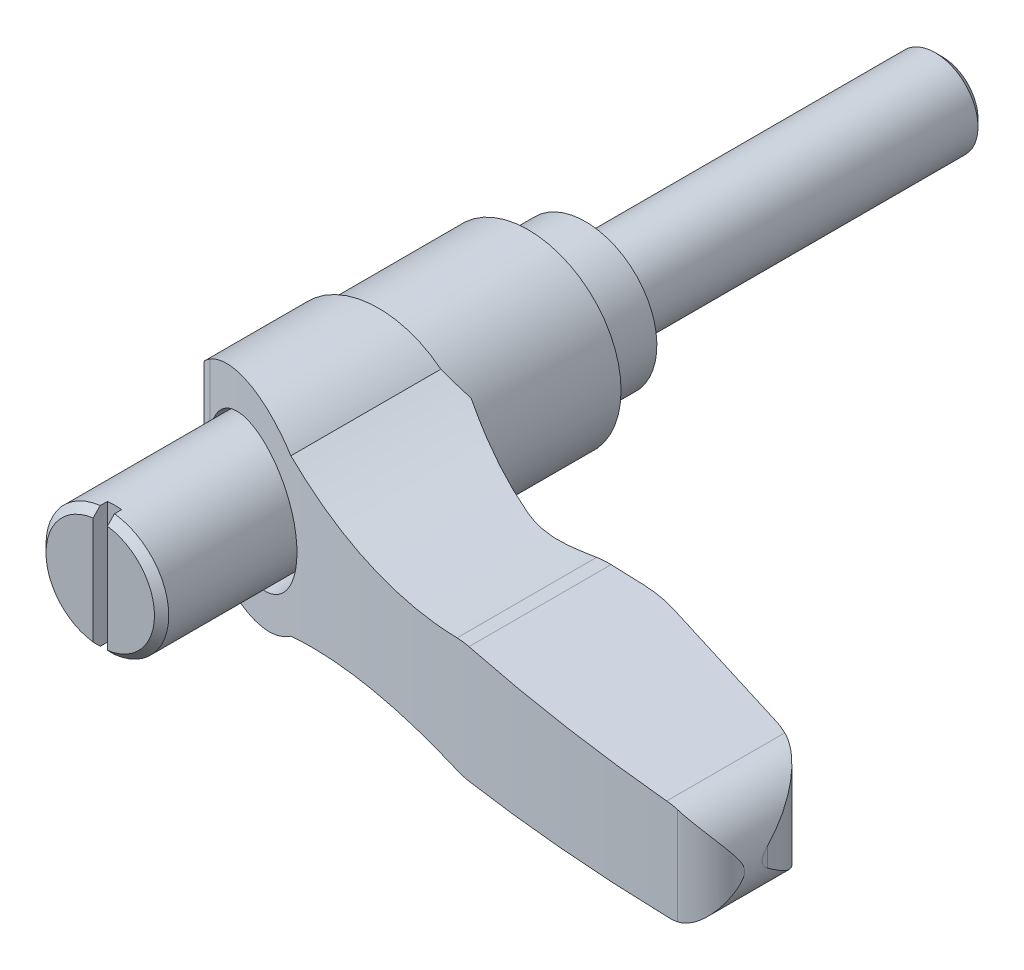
ISO-10303-21;
HEADER;
FILE_DESCRIPTION(('STEP AP214'),'2;1');
FILE_NAME('part.step','',(''),(''),'','','');
FILE_SCHEMA(('AUTOMOTIVE_DESIGN { 1 0 10303 214 1 1 1 1 }'));
ENDSEC;
DATA;
#1=APPLICATION_CONTEXT('core data for automotive mechanical design processes');
#2=APPLICATION_PROTOCOL_DEFINITION('international standard','automotive_design',2000,#1);
#3=PRODUCT_CONTEXT('',#1,'mechanical');
#4=PRODUCT('Part','Part','',(#3));
#5=PRODUCT_RELATED_PRODUCT_CATEGORY('part','',(#4));
#6=PRODUCT_DEFINITION_FORMATION('','',#4);
#7=PRODUCT_DEFINITION_CONTEXT('part definition',#1,'design');
#8=PRODUCT_DEFINITION('design','',#6,#7);
#9=PRODUCT_DEFINITION_SHAPE('','',#8);
#10=(LENGTH_UNIT() NAMED_UNIT(*) SI_UNIT(.MILLI.,.METRE.));
#11=(NAMED_UNIT(*) PLANE_ANGLE_UNIT() SI_UNIT($,.RADIAN.));
#12=(NAMED_UNIT(*) SI_UNIT($,.STERADIAN.) SOLID_ANGLE_UNIT());
#13=UNCERTAINTY_MEASURE_WITH_UNIT(LENGTH_MEASURE(1.E-05),#10,'distance_accuracy_value','');
#14=(GEOMETRIC_REPRESENTATION_CONTEXT(3) GLOBAL_UNCERTAINTY_ASSIGNED_CONTEXT((#13)) GLOBAL_UNIT_ASSIGNED_CONTEXT((#10,
#11,#12)) REPRESENTATION_CONTEXT('',''));
#15=CARTESIAN_POINT('',(0.,0.,0.));
#16=DIRECTION('',(0.,0.,1.));
#17=DIRECTION('',(1.,0.,0.));
#18=AXIS2_PLACEMENT_3D('',#15,#16,#17);
#19=CARTESIAN_POINT('',(0.,0.,-25.));
#20=DIRECTION('',(0.,0.,-1.));
#21=DIRECTION('',(0.,1.,0.));
#22=AXIS2_PLACEMENT_3D('',#19,#20,#21);
#23=PLANE('',#22);
#24=CARTESIAN_POINT('',(0.,0.,-25.));
#25=DIRECTION('',(0.,0.,-1.));
#26=DIRECTION('',(0.,1.,0.));
#27=AXIS2_PLACEMENT_3D('',#24,#25,#26);
#28=CIRCLE('',#27,2.5);
#29=CARTESIAN_POINT('',(0.,2.5,-25.));
#30=VERTEX_POINT('',#29);
#31=EDGE_CURVE('E289',#30,#30,#28,.T.);
#32=ORIENTED_EDGE('',*,*,#31,.T.);
#33=EDGE_LOOP('',(#32));
#34=FACE_BOUND('',#33,.T.);
#35=ADVANCED_FACE('F14',(#34),#23,.T.);
#36=CARTESIAN_POINT('',(0.,0.,-25.));
#37=DIRECTION('',(0.,0.,1.));
#38=DIRECTION('',(0.,-1.,0.));
#39=AXIS2_PLACEMENT_3D('',#36,#37,#38);
#40=CONICAL_SURFACE('',#39,2.5,0.785398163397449);
#41=CARTESIAN_POINT('',(0.,0.,-24.5));
#42=DIRECTION('',(0.,0.,-1.));
#43=DIRECTION('',(0.,1.,0.));
#44=AXIS2_PLACEMENT_3D('',#41,#42,#43);
#45=CIRCLE('',#44,3.);
#46=CARTESIAN_POINT('',(0.,3.,-24.5));
#47=VERTEX_POINT('',#46);
#48=EDGE_CURVE('E30',#47,#47,#45,.F.);
#49=ORIENTED_EDGE('',*,*,#48,.F.);
#50=EDGE_LOOP('',(#49));
#51=FACE_BOUND('',#50,.T.);
#52=ORIENTED_EDGE('',*,*,#31,.F.);
#53=EDGE_LOOP('',(#52));
#54=FACE_BOUND('',#53,.T.);
#55=ADVANCED_FACE('F525',(#51,#54),#40,.T.);
#56=CARTESIAN_POINT('',(0.,0.,-25.));
#57=DIRECTION('',(0.,0.,1.));
#58=DIRECTION('',(0.,-1.,0.));
#59=AXIS2_PLACEMENT_3D('',#56,#57,#58);
#60=CYLINDRICAL_SURFACE('',#59,3.);
#61=ORIENTED_EDGE('',*,*,#48,.T.);
#62=EDGE_LOOP('',(#61));
#63=FACE_BOUND('',#62,.T.);
#64=CARTESIAN_POINT('',(0.,0.,0.));
#65=DIRECTION('',(0.,0.,-1.));
#66=DIRECTION('',(0.,1.,0.));
#67=AXIS2_PLACEMENT_3D('',#64,#65,#66);
#68=CIRCLE('',#67,3.);
#69=CARTESIAN_POINT('',(0.,3.,0.));
#70=VERTEX_POINT('',#69);
#71=EDGE_CURVE('E543',#70,#70,#68,.T.);
#72=ORIENTED_EDGE('',*,*,#71,.T.);
#73=EDGE_LOOP('',(#72));
#74=FACE_BOUND('',#73,.T.);
#75=ADVANCED_FACE('F507',(#63,#74),#60,.T.);
#76=CARTESIAN_POINT('',(5.,0.,0.));
#77=DIRECTION('',(0.,0.,-1.));
#78=DIRECTION('',(0.,1.,0.));
#79=AXIS2_PLACEMENT_3D('',#76,#77,#78);
#80=PLANE('',#79);
#81=CARTESIAN_POINT('',(0.,0.,0.));
#82=DIRECTION('',(0.,0.,1.));
#83=DIRECTION('',(0.,-1.,0.));
#84=AXIS2_PLACEMENT_3D('',#81,#82,#83);
#85=CIRCLE('',#84,5.);
#86=CARTESIAN_POINT('',(0.,-5.,0.));
#87=VERTEX_POINT('',#86);
#88=EDGE_CURVE('E241',#87,#87,#85,.T.);
#89=ORIENTED_EDGE('',*,*,#88,.F.);
#90=EDGE_LOOP('',(#89));
#91=FACE_BOUND('',#90,.T.);
#92=ORIENTED_EDGE('',*,*,#71,.F.);
#93=EDGE_LOOP('',(#92));
#94=FACE_BOUND('',#93,.T.);
#95=ADVANCED_FACE('F501',(#91,#94),#80,.T.);
#96=CARTESIAN_POINT('',(0.,0.,4.));
#97=DIRECTION('',(0.,0.,1.));
#98=DIRECTION('',(0.,-1.,0.));
#99=AXIS2_PLACEMENT_3D('',#96,#97,#98);
#100=CYLINDRICAL_SURFACE('',#99,5.);
#101=ORIENTED_EDGE('',*,*,#88,.T.);
#102=EDGE_LOOP('',(#101));
#103=FACE_BOUND('',#102,.T.);
#104=CARTESIAN_POINT('',(0.,0.,4.55));
#105=DIRECTION('',(0.,0.,-1.));
#106=DIRECTION('',(1.,0.,0.));
#107=AXIS2_PLACEMENT_3D('',#104,#105,#106);
#108=CIRCLE('',#107,5.);
#109=CARTESIAN_POINT('',(5.,0.,4.55));
#110=VERTEX_POINT('',#109);
#111=EDGE_CURVE('E9',#110,#110,#108,.T.);
#112=ORIENTED_EDGE('',*,*,#111,.T.);
#113=EDGE_LOOP('',(#112));
#114=FACE_BOUND('',#113,.T.);
#115=ADVANCED_FACE('F493',(#103,#114),#100,.T.);
#116=CARTESIAN_POINT('',(0.,0.,34.));
#117=DIRECTION('',(0.,0.,-1.));
#118=DIRECTION('',(0.,1.,0.));
#119=AXIS2_PLACEMENT_3D('',#116,#117,#118);
#120=PLANE('',#119);
#121=CARTESIAN_POINT('',(0.,0.,34.));
#122=DIRECTION('',(0.,0.,-1.));
#123=DIRECTION('',(0.,1.,0.));
#124=AXIS2_PLACEMENT_3D('',#121,#122,#123);
#125=CIRCLE('',#124,3.8);
#126=CARTESIAN_POINT('',(0.5,-3.76696164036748,34.));
#127=VERTEX_POINT('',#126);
#128=CARTESIAN_POINT('',(0.5,3.76696164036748,34.));
#129=VERTEX_POINT('',#128);
#130=EDGE_CURVE('E244',#127,#129,#125,.F.);
#131=ORIENTED_EDGE('',*,*,#130,.T.);
#132=DIRECTION('',(0.,1.,0.));
#133=VECTOR('',#132,1.);
#134=CARTESIAN_POINT('',(0.5,5.,34.));
#135=LINE('',#134,#133);
#136=EDGE_CURVE('E547',#127,#129,#135,.T.);
#137=ORIENTED_EDGE('',*,*,#136,.F.);
#138=EDGE_LOOP('',(#131,#137));
#139=FACE_BOUND('',#138,.T.);
#140=ADVANCED_FACE('F490',(#139),#120,.F.);
#141=CARTESIAN_POINT('',(-0.5,3.76696164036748,34.));
#142=VERTEX_POINT('',#141);
#143=CARTESIAN_POINT('',(-0.5,-3.76696164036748,34.));
#144=VERTEX_POINT('',#143);
#145=EDGE_CURVE('E249',#142,#144,#125,.F.);
#146=ORIENTED_EDGE('',*,*,#145,.T.);
#147=DIRECTION('',(0.,-1.,0.));
#148=VECTOR('',#147,1.);
#149=CARTESIAN_POINT('',(-0.5,5.,34.));
#150=LINE('',#149,#148);
#151=EDGE_CURVE('E221',#142,#144,#150,.T.);
#152=ORIENTED_EDGE('',*,*,#151,.F.);
#153=EDGE_LOOP('',(#146,#152));
#154=FACE_BOUND('',#153,.T.);
#155=ADVANCED_FACE('F492',(#154),#120,.F.);
#156=CARTESIAN_POINT('',(0.,0.,33.5));
#157=DIRECTION('',(0.,0.,-1.));
#158=DIRECTION('',(0.,1.,0.));
#159=AXIS2_PLACEMENT_3D('',#156,#157,#158);
#160=CONICAL_SURFACE('',#159,4.3,0.785398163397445);
#161=CARTESIAN_POINT('',(-0.5,7.14579003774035,30.6367385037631));
#162=CARTESIAN_POINT('',(-0.5,6.87469589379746,30.907163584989));
#163=CARTESIAN_POINT('',(-0.5,6.60357153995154,31.1775584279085));
#164=CARTESIAN_POINT('',(-0.5,6.0612255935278,31.7182262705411));
#165=CARTESIAN_POINT('',(-0.5,5.79000400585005,31.9884992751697));
#166=CARTESIAN_POINT('',(-0.5,5.24743596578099,32.5288529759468));
#167=CARTESIAN_POINT('',(-0.5,4.97608953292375,32.7989336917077));
#168=CARTESIAN_POINT('',(-0.5,4.43313294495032,33.3388536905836));
#169=CARTESIAN_POINT('',(-0.5,4.16152277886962,33.6086929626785));
#170=CARTESIAN_POINT('',(-0.5,3.75373708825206,34.0131478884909));
#171=CARTESIAN_POINT('',(-0.5,3.61772939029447,34.1479327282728));
#172=CARTESIAN_POINT('',(-0.5,3.34555849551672,34.41734068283));
#173=CARTESIAN_POINT('',(-0.5,3.20939530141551,34.5519638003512));
#174=CARTESIAN_POINT('',(-0.5,2.93685991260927,34.8209619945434));
#175=CARTESIAN_POINT('',(-0.5,2.80048774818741,34.9553371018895));
#176=CARTESIAN_POINT('',(-0.5,2.52739320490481,35.2237482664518));
#177=CARTESIAN_POINT('',(-0.5,2.39067080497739,35.3577843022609));
#178=CARTESIAN_POINT('',(-0.5,2.18513448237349,35.5584388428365));
#179=CARTESIAN_POINT('',(-0.5,2.11653083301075,35.6252726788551));
#180=CARTESIAN_POINT('',(-0.5,1.97913719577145,35.7587462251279));
#181=CARTESIAN_POINT('',(-0.5,1.91034721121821,35.8253859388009));
#182=CARTESIAN_POINT('',(-0.5,1.77252789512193,35.9583896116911));
#183=CARTESIAN_POINT('',(-0.5,1.70349861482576,36.0247536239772));
#184=CARTESIAN_POINT('',(-0.5,1.56508132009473,36.1571160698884));
#185=CARTESIAN_POINT('',(-0.5,1.49569328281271,36.223114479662));
#186=CARTESIAN_POINT('',(-0.5,1.35634903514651,36.3546106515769));
#187=CARTESIAN_POINT('',(-0.5,1.28639245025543,36.4201080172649));
#188=CARTESIAN_POINT('',(-0.5,1.14569948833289,36.5502396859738));
#189=CARTESIAN_POINT('',(-0.5,1.07496325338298,36.6148741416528));
#190=CARTESIAN_POINT('',(-0.5,0.967839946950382,36.7107505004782));
#191=CARTESIAN_POINT('',(-0.5,0.931946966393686,36.7425432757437));
#192=CARTESIAN_POINT('',(-0.5,0.859716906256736,36.8056137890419));
#193=CARTESIAN_POINT('',(-0.5,0.823379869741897,36.8368915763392));
#194=CARTESIAN_POINT('',(-0.5,0.750082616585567,36.8987629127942));
#195=CARTESIAN_POINT('',(-0.5,0.713122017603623,36.9293560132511));
#196=CARTESIAN_POINT('',(-0.5,0.638313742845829,36.9894602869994));
#197=CARTESIAN_POINT('',(-0.5,0.600465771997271,37.0189710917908));
#198=CARTESIAN_POINT('',(-0.5,0.562043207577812,37.0477416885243));
#199=B_SPLINE_CURVE_WITH_KNOTS('',3,(#161,#162,#163,#164,#165,#166,#167,#168,#169,#170,#171,
#172,#173,#174,#175,#176,#177,#178,#179,#180,#181,#182,#183,#184,#185,#186,#187,#188,#189,#190,
#191,#192,#193,#194,#195,#196,#197,#198),.UNSPECIFIED.,.F.,.F.,(4,2,2,2,2,2,2,2,2,2,2,2,2,2,2,2,
2,2,4),(0.,1.14873667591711,2.29742189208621,3.44596538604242,4.59455887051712,5.1690023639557,
5.74343596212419,6.31779297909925,6.89218539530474,7.17951595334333,7.46684142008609,
7.75410874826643,8.04139460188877,8.32888815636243,8.61633015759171,8.76017280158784,
8.90400160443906,9.04792205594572,9.19189106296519),.UNSPECIFIED.);
#200=CARTESIAN_POINT('',(-0.5,4.27083130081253,33.5));
#201=VERTEX_POINT('',#200);
#202=EDGE_CURVE('E190',#201,#142,#199,.T.);
#203=ORIENTED_EDGE('',*,*,#202,.F.);
#204=CARTESIAN_POINT('',(0.,0.,33.5));
#205=DIRECTION('',(0.,0.,-1.));
#206=DIRECTION('',(0.,1.,0.));
#207=AXIS2_PLACEMENT_3D('',#204,#205,#206);
#208=CIRCLE('',#207,4.3);
#209=CARTESIAN_POINT('',(-0.5,-4.27083130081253,33.5));
#210=VERTEX_POINT('',#209);
#211=EDGE_CURVE('E234',#210,#201,#208,.T.);
#212=ORIENTED_EDGE('',*,*,#211,.F.);
#213=CARTESIAN_POINT('',(-0.5,-0.562043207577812,37.0477416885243));
#214=CARTESIAN_POINT('',(-0.5,-0.591562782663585,37.0256612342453));
#215=CARTESIAN_POINT('',(-0.5,-0.620732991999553,37.0031254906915));
#216=CARTESIAN_POINT('',(-0.5,-0.678508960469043,36.9573533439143));
#217=CARTESIAN_POINT('',(-0.5,-0.707114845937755,36.9341171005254));
#218=CARTESIAN_POINT('',(-0.5,-0.763893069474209,36.8871574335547));
#219=CARTESIAN_POINT('',(-0.5,-0.792065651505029,36.8634343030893));
#220=CARTESIAN_POINT('',(-0.5,-0.848085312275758,36.8156036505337));
#221=CARTESIAN_POINT('',(-0.5,-0.875932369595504,36.7914961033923));
#222=CARTESIAN_POINT('',(-0.5,-0.959051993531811,36.7187712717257));
#223=CARTESIAN_POINT('',(-0.5,-1.0139429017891,36.669718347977));
#224=CARTESIAN_POINT('',(-0.5,-1.12306845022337,36.5708712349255));
#225=CARTESIAN_POINT('',(-0.5,-1.17730296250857,36.5210769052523));
#226=CARTESIAN_POINT('',(-0.5,-1.34475427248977,36.3659472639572));
#227=CARTESIAN_POINT('',(-0.5,-1.4572060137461,36.2597875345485));
#228=CARTESIAN_POINT('',(-0.5,-1.68111383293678,36.0464226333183));
#229=CARTESIAN_POINT('',(-0.5,-1.79256987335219,35.9392174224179));
#230=CARTESIAN_POINT('',(-0.5,-2.01488759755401,35.7241936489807));
#231=CARTESIAN_POINT('',(-0.5,-2.12574928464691,35.6163750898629));
#232=CARTESIAN_POINT('',(-0.5,-2.34709619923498,35.4003567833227));
#233=CARTESIAN_POINT('',(-0.5,-2.45758143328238,35.2921570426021));
#234=CARTESIAN_POINT('',(-0.5,-2.78891994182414,34.9669349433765));
#235=CARTESIAN_POINT('',(-0.5,-3.00940313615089,34.7495356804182));
#236=CARTESIAN_POINT('',(-0.5,-3.44986918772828,34.3142422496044));
#237=CARTESIAN_POINT('',(-0.5,-3.66985205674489,34.096348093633));
#238=CARTESIAN_POINT('',(-0.5,-4.16175150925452,33.6084656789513));
#239=CARTESIAN_POINT('',(-0.5,-4.43359041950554,33.3383991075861));
#240=CARTESIAN_POINT('',(-0.5,-4.97701825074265,32.798009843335));
#241=CARTESIAN_POINT('',(-0.5,-5.24860716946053,32.5276871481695));
#242=CARTESIAN_POINT('',(-0.5,-5.79118913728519,31.9873183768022));
#243=CARTESIAN_POINT('',(-0.5,-6.06218244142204,31.7172725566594));
#244=CARTESIAN_POINT('',(-0.5,-6.60405724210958,31.1770740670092));
#245=CARTESIAN_POINT('',(-0.5,-6.87493873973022,30.9069213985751));
#246=CARTESIAN_POINT('',(-0.5,-7.14579003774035,30.6367385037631));
#247=B_SPLINE_CURVE_WITH_KNOTS('',3,(#213,#214,#215,#216,#217,#218,#219,#220,#221,#222,#223,
#224,#225,#226,#227,#228,#229,#230,#231,#232,#233,#234,#235,#236,#237,#238,#239,#240,#241,#242,
#243,#244,#245,#246),.UNSPECIFIED.,.F.,.F.,(4,2,2,2,2,2,2,2,2,2,2,2,2,2,2,2,4),(0.,
0.110577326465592,0.221129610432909,0.331617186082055,0.442111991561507,0.662945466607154,
0.883821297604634,1.34774036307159,1.81167683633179,2.27561072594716,2.7395364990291,
3.66844637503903,4.59733417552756,5.74689505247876,6.8964662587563,8.04418527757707,
9.19189304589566),.UNSPECIFIED.);
#248=EDGE_CURVE('E215',#144,#210,#247,.T.);
#249=ORIENTED_EDGE('',*,*,#248,.F.);
#250=ORIENTED_EDGE('',*,*,#145,.F.);
#251=EDGE_LOOP('',(#203,#212,#249,#250));
#252=FACE_BOUND('',#251,.T.);
#253=ADVANCED_FACE('F239',(#252),#160,.T.);
#254=CARTESIAN_POINT('',(0.5,0.562043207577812,37.0477416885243));
#255=CARTESIAN_POINT('',(0.5,0.591562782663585,37.0256612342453));
#256=CARTESIAN_POINT('',(0.5,0.620732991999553,37.0031254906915));
#257=CARTESIAN_POINT('',(0.5,0.678508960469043,36.9573533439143));
#258=CARTESIAN_POINT('',(0.5,0.707114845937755,36.9341171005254));
#259=CARTESIAN_POINT('',(0.5,0.763893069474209,36.8871574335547));
#260=CARTESIAN_POINT('',(0.5,0.792065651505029,36.8634343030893));
#261=CARTESIAN_POINT('',(0.5,0.848085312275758,36.8156036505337));
#262=CARTESIAN_POINT('',(0.5,0.875932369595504,36.7914961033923));
#263=CARTESIAN_POINT('',(0.5,0.959051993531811,36.7187712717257));
#264=CARTESIAN_POINT('',(0.5,1.0139429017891,36.669718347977));
#265=CARTESIAN_POINT('',(0.5,1.12306845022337,36.5708712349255));
#266=CARTESIAN_POINT('',(0.5,1.17730296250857,36.5210769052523));
#267=CARTESIAN_POINT('',(0.5,1.34475427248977,36.3659472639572));
#268=CARTESIAN_POINT('',(0.5,1.4572060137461,36.2597875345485));
#269=CARTESIAN_POINT('',(0.5,1.68111383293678,36.0464226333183));
#270=CARTESIAN_POINT('',(0.5,1.79256987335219,35.9392174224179));
#271=CARTESIAN_POINT('',(0.5,2.01488759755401,35.7241936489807));
#272=CARTESIAN_POINT('',(0.5,2.12574928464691,35.6163750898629));
#273=CARTESIAN_POINT('',(0.5,2.34709619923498,35.4003567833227));
#274=CARTESIAN_POINT('',(0.5,2.45758143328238,35.2921570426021));
#275=CARTESIAN_POINT('',(0.5,2.78891994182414,34.9669349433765));
#276=CARTESIAN_POINT('',(0.5,3.00940313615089,34.7495356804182));
#277=CARTESIAN_POINT('',(0.5,3.44986918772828,34.3142422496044));
#278=CARTESIAN_POINT('',(0.5,3.66985205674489,34.096348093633));
#279=CARTESIAN_POINT('',(0.5,4.16175150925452,33.6084656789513));
#280=CARTESIAN_POINT('',(0.5,4.43359041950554,33.3383991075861));
#281=CARTESIAN_POINT('',(0.5,4.97701825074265,32.798009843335));
#282=CARTESIAN_POINT('',(0.5,5.24860716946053,32.5276871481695));
#283=CARTESIAN_POINT('',(0.5,5.79118913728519,31.9873183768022));
#284=CARTESIAN_POINT('',(0.5,6.06218244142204,31.7172725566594));
#285=CARTESIAN_POINT('',(0.5,6.60405724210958,31.1770740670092));
#286=CARTESIAN_POINT('',(0.5,6.87493873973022,30.9069213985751));
#287=CARTESIAN_POINT('',(0.5,7.14579003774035,30.6367385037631));
#288=B_SPLINE_CURVE_WITH_KNOTS('',3,(#254,#255,#256,#257,#258,#259,#260,#261,#262,#263,#264,
#265,#266,#267,#268,#269,#270,#271,#272,#273,#274,#275,#276,#277,#278,#279,#280,#281,#282,#283,
#284,#285,#286,#287),.UNSPECIFIED.,.F.,.F.,(4,2,2,2,2,2,2,2,2,2,2,2,2,2,2,2,4),(0.,
0.110577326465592,0.221129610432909,0.331617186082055,0.442111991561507,0.662945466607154,
0.883821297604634,1.34774036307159,1.81167683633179,2.27561072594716,2.7395364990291,
3.66844637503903,4.59733417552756,5.74689505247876,6.8964662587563,8.04418527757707,
9.19189304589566),.UNSPECIFIED.);
#289=CARTESIAN_POINT('',(0.5,4.27083130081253,33.5));
#290=VERTEX_POINT('',#289);
#291=EDGE_CURVE('E226',#129,#290,#288,.T.);
#292=ORIENTED_EDGE('',*,*,#291,.F.);
#293=ORIENTED_EDGE('',*,*,#130,.F.);
#294=CARTESIAN_POINT('',(0.5,-7.14579003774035,30.6367385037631));
#295=CARTESIAN_POINT('',(0.5,-6.87469589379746,30.907163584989));
#296=CARTESIAN_POINT('',(0.5,-6.60357153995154,31.1775584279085));
#297=CARTESIAN_POINT('',(0.5,-6.0612255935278,31.7182262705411));
#298=CARTESIAN_POINT('',(0.5,-5.79000400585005,31.9884992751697));
#299=CARTESIAN_POINT('',(0.5,-5.24743596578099,32.5288529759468));
#300=CARTESIAN_POINT('',(0.5,-4.97608953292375,32.7989336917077));
#301=CARTESIAN_POINT('',(0.5,-4.43313294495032,33.3388536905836));
#302=CARTESIAN_POINT('',(0.5,-4.16152277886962,33.6086929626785));
#303=CARTESIAN_POINT('',(0.5,-3.75373708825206,34.0131478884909));
#304=CARTESIAN_POINT('',(0.5,-3.61772939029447,34.1479327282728));
#305=CARTESIAN_POINT('',(0.5,-3.34555849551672,34.41734068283));
#306=CARTESIAN_POINT('',(0.5,-3.20939530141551,34.5519638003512));
#307=CARTESIAN_POINT('',(0.5,-2.93685991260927,34.8209619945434));
#308=CARTESIAN_POINT('',(0.5,-2.80048774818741,34.9553371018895));
#309=CARTESIAN_POINT('',(0.5,-2.52739320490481,35.2237482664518));
#310=CARTESIAN_POINT('',(0.5,-2.39067080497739,35.3577843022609));
#311=CARTESIAN_POINT('',(0.5,-2.18513448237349,35.5584388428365));
#312=CARTESIAN_POINT('',(0.5,-2.11653083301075,35.6252726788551));
#313=CARTESIAN_POINT('',(0.5,-1.97913719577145,35.7587462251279));
#314=CARTESIAN_POINT('',(0.5,-1.91034721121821,35.8253859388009));
#315=CARTESIAN_POINT('',(0.5,-1.77252789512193,35.9583896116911));
#316=CARTESIAN_POINT('',(0.5,-1.70349861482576,36.0247536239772));
#317=CARTESIAN_POINT('',(0.5,-1.56508132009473,36.1571160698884));
#318=CARTESIAN_POINT('',(0.5,-1.49569328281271,36.223114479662));
#319=CARTESIAN_POINT('',(0.5,-1.35634903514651,36.3546106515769));
#320=CARTESIAN_POINT('',(0.5,-1.28639245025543,36.4201080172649));
#321=CARTESIAN_POINT('',(0.5,-1.14569948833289,36.5502396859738));
#322=CARTESIAN_POINT('',(0.5,-1.07496325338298,36.6148741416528));
#323=CARTESIAN_POINT('',(0.5,-0.967839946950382,36.7107505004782));
#324=CARTESIAN_POINT('',(0.5,-0.931946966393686,36.7425432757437));
#325=CARTESIAN_POINT('',(0.5,-0.859716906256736,36.8056137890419));
#326=CARTESIAN_POINT('',(0.5,-0.823379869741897,36.8368915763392));
#327=CARTESIAN_POINT('',(0.5,-0.750082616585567,36.8987629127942));
#328=CARTESIAN_POINT('',(0.5,-0.713122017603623,36.9293560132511));
#329=CARTESIAN_POINT('',(0.5,-0.638313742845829,36.9894602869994));
#330=CARTESIAN_POINT('',(0.5,-0.600465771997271,37.0189710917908));
#331=CARTESIAN_POINT('',(0.5,-0.562043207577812,37.0477416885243));
#332=B_SPLINE_CURVE_WITH_KNOTS('',3,(#294,#295,#296,#297,#298,#299,#300,#301,#302,#303,#304,
#305,#306,#307,#308,#309,#310,#311,#312,#313,#314,#315,#316,#317,#318,#319,#320,#321,#322,#323,
#324,#325,#326,#327,#328,#329,#330,#331),.UNSPECIFIED.,.F.,.F.,(4,2,2,2,2,2,2,2,2,2,2,2,2,2,2,2,
2,2,4),(0.,1.14873667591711,2.29742189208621,3.44596538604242,4.59455887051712,5.1690023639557,
5.74343596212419,6.31779297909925,6.89218539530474,7.17951595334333,7.46684142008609,
7.75410874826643,8.04139460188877,8.32888815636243,8.61633015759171,8.76017280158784,
8.90400160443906,9.04792205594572,9.19189106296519),.UNSPECIFIED.);
#333=CARTESIAN_POINT('',(0.5,-4.27083130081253,33.5));
#334=VERTEX_POINT('',#333);
#335=EDGE_CURVE('E251',#334,#127,#332,.T.);
#336=ORIENTED_EDGE('',*,*,#335,.F.);
#337=EDGE_CURVE('E240',#290,#334,#208,.T.);
#338=ORIENTED_EDGE('',*,*,#337,.F.);
#339=EDGE_LOOP('',(#292,#293,#336,#338));
#340=FACE_BOUND('',#339,.T.);
#341=ADVANCED_FACE('F263',(#340),#160,.T.);
#342=CARTESIAN_POINT('',(0.5,5.,33.));
#343=DIRECTION('',(1.,0.,0.));
#344=DIRECTION('',(0.,1.,0.));
#345=AXIS2_PLACEMENT_3D('',#342,#343,#344);
#346=PLANE('',#345);
#347=DIRECTION('',(0.,0.,1.));
#348=VECTOR('',#347,1.);
#349=CARTESIAN_POINT('',(0.5,4.27083130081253,4.));
#350=LINE('',#349,#348);
#351=CARTESIAN_POINT('',(0.5,4.27083130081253,33.));
#352=VERTEX_POINT('',#351);
#353=EDGE_CURVE('E237',#290,#352,#350,.F.);
#354=ORIENTED_EDGE('',*,*,#353,.T.);
#355=DIRECTION('',(0.,1.,0.));
#356=VECTOR('',#355,1.);
#357=CARTESIAN_POINT('',(0.5,5.,33.));
#358=LINE('',#357,#356);
#359=CARTESIAN_POINT('',(0.5,-4.27083130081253,33.));
#360=VERTEX_POINT('',#359);
#361=EDGE_CURVE('E555',#360,#352,#358,.T.);
#362=ORIENTED_EDGE('',*,*,#361,.F.);
#363=DIRECTION('',(0.,0.,1.));
#364=VECTOR('',#363,1.);
#365=CARTESIAN_POINT('',(0.5,-4.27083130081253,4.));
#366=LINE('',#365,#364);
#367=EDGE_CURVE('E39',#360,#334,#366,.T.);
#368=ORIENTED_EDGE('',*,*,#367,.T.);
#369=ORIENTED_EDGE('',*,*,#335,.T.);
#370=ORIENTED_EDGE('',*,*,#136,.T.);
#371=ORIENTED_EDGE('',*,*,#291,.T.);
#372=EDGE_LOOP('',(#354,#362,#368,#369,#370,#371));
#373=FACE_BOUND('',#372,.T.);
#374=ADVANCED_FACE('F267',(#373),#346,.F.);
#375=CARTESIAN_POINT('',(-0.5,-5.,33.));
#376=DIRECTION('',(0.,0.,1.));
#377=DIRECTION('',(0.,-1.,0.));
#378=AXIS2_PLACEMENT_3D('',#375,#376,#377);
#379=PLANE('',#378);
#380=DIRECTION('',(0.,-1.,0.));
#381=VECTOR('',#380,1.);
#382=CARTESIAN_POINT('',(-0.5,5.,33.));
#383=LINE('',#382,#381);
#384=CARTESIAN_POINT('',(-0.5,4.27083130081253,33.));
#385=VERTEX_POINT('',#384);
#386=CARTESIAN_POINT('',(-0.5,-4.27083130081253,33.));
#387=VERTEX_POINT('',#386);
#388=EDGE_CURVE('E553',#385,#387,#383,.T.);
#389=ORIENTED_EDGE('',*,*,#388,.T.);
#390=CARTESIAN_POINT('',(0.,0.,33.));
#391=DIRECTION('',(0.,0.,1.));
#392=DIRECTION('',(0.,-1.,0.));
#393=AXIS2_PLACEMENT_3D('',#390,#391,#392);
#394=CIRCLE('',#393,4.3);
#395=EDGE_CURVE('E235',#360,#387,#394,.F.);
#396=ORIENTED_EDGE('',*,*,#395,.F.);
#397=ORIENTED_EDGE('',*,*,#361,.T.);
#398=EDGE_CURVE('E288',#385,#352,#394,.F.);
#399=ORIENTED_EDGE('',*,*,#398,.F.);
#400=EDGE_LOOP('',(#389,#396,#397,#399));
#401=FACE_BOUND('',#400,.T.);
#402=ADVANCED_FACE('F271',(#401),#379,.T.);
#403=CARTESIAN_POINT('',(-0.5,5.,33.));
#404=DIRECTION('',(-1.,0.,0.));
#405=DIRECTION('',(0.,-1.,0.));
#406=AXIS2_PLACEMENT_3D('',#403,#404,#405);
#407=PLANE('',#406);
#408=DIRECTION('',(0.,0.,1.));
#409=VECTOR('',#408,1.);
#410=CARTESIAN_POINT('',(-0.5,4.27083130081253,4.));
#411=LINE('',#410,#409);
#412=EDGE_CURVE('E236',#385,#201,#411,.T.);
#413=ORIENTED_EDGE('',*,*,#412,.T.);
#414=ORIENTED_EDGE('',*,*,#202,.T.);
#415=ORIENTED_EDGE('',*,*,#151,.T.);
#416=ORIENTED_EDGE('',*,*,#248,.T.);
#417=DIRECTION('',(0.,0.,1.));
#418=VECTOR('',#417,1.);
#419=CARTESIAN_POINT('',(-0.5,-4.27083130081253,4.));
#420=LINE('',#419,#418);
#421=EDGE_CURVE('E219',#210,#387,#420,.F.);
#422=ORIENTED_EDGE('',*,*,#421,.T.);
#423=ORIENTED_EDGE('',*,*,#388,.F.);
#424=EDGE_LOOP('',(#413,#414,#415,#416,#422,#423));
#425=FACE_BOUND('',#424,.T.);
#426=ADVANCED_FACE('F217',(#425),#407,.F.);
#427=CARTESIAN_POINT('',(0.,0.,4.));
#428=DIRECTION('',(0.,0.,1.));
#429=DIRECTION('',(0.,-1.,0.));
#430=AXIS2_PLACEMENT_3D('',#427,#428,#429);
#431=CYLINDRICAL_SURFACE('',#430,4.3);
#432=ORIENTED_EDGE('',*,*,#412,.F.);
#433=ORIENTED_EDGE('',*,*,#398,.T.);
#434=ORIENTED_EDGE('',*,*,#353,.F.);
#435=ORIENTED_EDGE('',*,*,#337,.T.);
#436=ORIENTED_EDGE('',*,*,#367,.F.);
#437=ORIENTED_EDGE('',*,*,#395,.T.);
#438=ORIENTED_EDGE('',*,*,#421,.F.);
#439=ORIENTED_EDGE('',*,*,#211,.T.);
#440=EDGE_LOOP('',(#432,#433,#434,#435,#436,#437,#438,#439));
#441=FACE_BOUND('',#440,.T.);
#442=CARTESIAN_POINT('',(0.,0.,21.34));
#443=DIRECTION('',(0.,0.,-1.));
#444=DIRECTION('',(0.,1.,0.));
#445=AXIS2_PLACEMENT_3D('',#442,#443,#444);
#446=CIRCLE('',#445,4.3);
#447=CARTESIAN_POINT('',(0.,4.3,21.34));
#448=VERTEX_POINT('',#447);
#449=EDGE_CURVE('E545',#448,#448,#446,.F.);
#450=ORIENTED_EDGE('',*,*,#449,.T.);
#451=EDGE_LOOP('',(#450));
#452=FACE_BOUND('',#451,.T.);
#453=ADVANCED_FACE('F232',(#441,#452),#431,.T.);
#454=CARTESIAN_POINT('',(-0.009999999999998,0.,16.5625));
#455=DIRECTION('',(0.,0.,-1.));
#456=DIRECTION('',(1.,0.,0.));
#457=AXIS2_PLACEMENT_3D('',#454,#455,#456);
#458=CYLINDRICAL_SURFACE('',#457,6.5);
#459=CARTESIAN_POINT('',(-0.0099999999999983,0.,14.5));
#460=DIRECTION('',(0.,0.,1.));
#461=DIRECTION('',(0.,-1.,0.));
#462=AXIS2_PLACEMENT_3D('',#459,#460,#461);
#463=CIRCLE('',#462,6.5);
#464=CARTESIAN_POINT('',(-6.51,0.,14.5));
#465=VERTEX_POINT('',#464);
#466=CARTESIAN_POINT('',(6.49,0.,14.5));
#467=VERTEX_POINT('',#466);
#468=EDGE_CURVE('E1166',#465,#467,#463,.T.);
#469=ORIENTED_EDGE('',*,*,#468,.F.);
#470=EDGE_CURVE('E1055',#467,#465,#463,.T.);
#471=ORIENTED_EDGE('',*,*,#470,.F.);
#472=EDGE_LOOP('',(#469,#471));
#473=FACE_BOUND('',#472,.T.);
#474=CARTESIAN_POINT('',(-0.0100000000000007,0.,-2.35002265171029));
#475=DIRECTION('',(0.707106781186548,0.,0.707106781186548));
#476=DIRECTION('',(0.707106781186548,0.,-0.707106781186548));
#477=AXIS2_PLACEMENT_3D('',#474,#475,#476);
#478=ELLIPSE('',#477,9.19238815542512,6.5);
#479=CARTESIAN_POINT('',(-6.3600226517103,-1.38824072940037,4.));
#480=VERTEX_POINT('',#479);
#481=CARTESIAN_POINT('',(-6.3600226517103,1.38824072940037,4.));
#482=VERTEX_POINT('',#481);
#483=EDGE_CURVE('E1163',#480,#482,#478,.F.);
#484=ORIENTED_EDGE('',*,*,#483,.F.);
#485=CARTESIAN_POINT('',(-0.0099999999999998,0.,4.));
#486=DIRECTION('',(0.,0.,-1.));
#487=DIRECTION('',(1.,0.,0.));
#488=AXIS2_PLACEMENT_3D('',#485,#486,#487);
#489=CIRCLE('',#488,6.5);
#490=EDGE_CURVE('E176',#482,#480,#489,.T.);
#491=ORIENTED_EDGE('',*,*,#490,.F.);
#492=EDGE_LOOP('',(#484,#491));
#493=FACE_BOUND('',#492,.T.);
#494=ADVANCED_FACE('F322',(#473,#493),#458,.T.);
#495=CARTESIAN_POINT('',(-6.51,-14.,4.1499773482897));
#496=DIRECTION('',(0.707106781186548,0.,0.707106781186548));
#497=DIRECTION('',(-0.707106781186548,0.,0.707106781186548));
#498=AXIS2_PLACEMENT_3D('',#495,#496,#497);
#499=PLANE('',#498);
#500=ORIENTED_EDGE('',*,*,#483,.T.);
#501=DIRECTION('',(0.,1.,0.));
#502=VECTOR('',#501,1.);
#503=CARTESIAN_POINT('',(-6.3600226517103,-14.,4.));
#504=LINE('',#503,#502);
#505=EDGE_CURVE('E303',#480,#482,#504,.T.);
#506=ORIENTED_EDGE('',*,*,#505,.F.);
#507=EDGE_LOOP('',(#500,#506));
#508=FACE_BOUND('',#507,.T.);
#509=ADVANCED_FACE('F316',(#508),#499,.F.);
#510=CARTESIAN_POINT('',(-0.0099999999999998,0.,4.));
#511=DIRECTION('',(0.,0.,-1.));
#512=DIRECTION('',(1.,0.,0.));
#513=AXIS2_PLACEMENT_3D('',#510,#511,#512);
#514=PLANE('',#513);
#515=CARTESIAN_POINT('',(0.,0.,4.));
#516=DIRECTION('',(0.,0.,-1.));
#517=DIRECTION('',(1.,0.,0.));
#518=AXIS2_PLACEMENT_3D('',#515,#516,#517);
#519=CIRCLE('',#518,5.25);
#520=CARTESIAN_POINT('',(5.25,0.,4.));
#521=VERTEX_POINT('',#520);
#522=EDGE_CURVE('E1037',#521,#521,#519,.T.);
#523=ORIENTED_EDGE('',*,*,#522,.F.);
#524=EDGE_LOOP('',(#523));
#525=FACE_BOUND('',#524,.T.);
#526=ORIENTED_EDGE('',*,*,#505,.T.);
#527=ORIENTED_EDGE('',*,*,#490,.T.);
#528=EDGE_LOOP('',(#526,#527));
#529=FACE_BOUND('',#528,.T.);
#530=ADVANCED_FACE('F321',(#525,#529),#514,.T.);
#531=CARTESIAN_POINT('',(0.,0.,4.));
#532=DIRECTION('',(0.,0.,1.));
#533=DIRECTION('',(0.,-1.,0.));
#534=AXIS2_PLACEMENT_3D('',#531,#532,#533);
#535=CYLINDRICAL_SURFACE('',#534,5.25);
#536=ORIENTED_EDGE('',*,*,#522,.T.);
#537=EDGE_LOOP('',(#536));
#538=FACE_BOUND('',#537,.T.);
#539=CARTESIAN_POINT('',(0.,0.,4.3));
#540=DIRECTION('',(0.,0.,1.));
#541=DIRECTION('',(0.,-1.,0.));
#542=AXIS2_PLACEMENT_3D('',#539,#540,#541);
#543=CIRCLE('',#542,5.25);
#544=CARTESIAN_POINT('',(0.,-5.25,4.3));
#545=VERTEX_POINT('',#544);
#546=EDGE_CURVE('E294',#545,#545,#543,.T.);
#547=ORIENTED_EDGE('',*,*,#546,.T.);
#548=EDGE_LOOP('',(#547));
#549=FACE_BOUND('',#548,.T.);
#550=ADVANCED_FACE('F511',(#538,#549),#535,.F.);
#551=CARTESIAN_POINT('',(0.,0.,4.55));
#552=DIRECTION('',(0.,0.,-1.));
#553=DIRECTION('',(0.,1.,0.));
#554=AXIS2_PLACEMENT_3D('',#551,#552,#553);
#555=CONICAL_SURFACE('',#554,5.,0.785398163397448);
#556=ORIENTED_EDGE('',*,*,#546,.F.);
#557=EDGE_LOOP('',(#556));
#558=FACE_BOUND('',#557,.T.);
#559=ORIENTED_EDGE('',*,*,#111,.F.);
#560=EDGE_LOOP('',(#559));
#561=FACE_BOUND('',#560,.T.);
#562=ADVANCED_FACE('F315',(#558,#561),#555,.F.);
#563=CARTESIAN_POINT('',(39.938965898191,-8.,27.204249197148));
#564=DIRECTION('',(-0.989626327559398,0.,0.143665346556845));
#565=DIRECTION('',(-0.143665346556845,0.,-0.989626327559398));
#566=AXIS2_PLACEMENT_3D('',#563,#564,#565);
#567=PLANE('',#566);
#568=CARTESIAN_POINT('',(36.5,0.,3.51522972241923));
#569=DIRECTION('',(-0.989626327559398,0.,0.143665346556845));
#570=DIRECTION('',(0.143665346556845,0.,0.989626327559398));
#571=AXIS2_PLACEMENT_3D('',#568,#569,#570);
#572=ELLIPSE('',#571,24.3621728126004,3.5);
#573=CARTESIAN_POINT('',(39.938965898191,-0.650779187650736,27.204249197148));
#574=VERTEX_POINT('',#573);
#575=CARTESIAN_POINT('',(39.938965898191,0.650779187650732,27.204249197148));
#576=VERTEX_POINT('',#575);
#577=EDGE_CURVE('E463',#574,#576,#572,.T.);
#578=ORIENTED_EDGE('',*,*,#577,.F.);
#579=DIRECTION('',(0.,1.,0.));
#580=VECTOR('',#579,1.);
#581=CARTESIAN_POINT('',(39.938965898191,-8.,27.204249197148));
#582=LINE('',#581,#580);
#583=EDGE_CURVE('E1061',#574,#576,#582,.T.);
#584=ORIENTED_EDGE('',*,*,#583,.T.);
#585=EDGE_LOOP('',(#578,#584));
#586=FACE_BOUND('',#585,.T.);
#587=ADVANCED_FACE('F475',(#586),#567,.F.);
#588=CARTESIAN_POINT('',(33.8626602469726,-8.,28.0863544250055));
#589=DIRECTION('',(0.,1.,0.));
#590=DIRECTION('',(-1.,0.,0.));
#591=AXIS2_PLACEMENT_3D('',#588,#589,#590);
#592=CYLINDRICAL_SURFACE('',#591,6.14000000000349);
#593=CARTESIAN_POINT('',(33.8626602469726,3.59762871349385,28.0863544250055));
#594=DIRECTION('',(0.0369925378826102,0.999315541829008,0.));
#595=DIRECTION('',(-0.999315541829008,0.0369925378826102,0.));
#596=AXIS2_PLACEMENT_3D('',#593,#594,#595);
#597=ELLIPSE('',#596,6.14420545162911,6.14000000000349);
#598=CARTESIAN_POINT('',(36.5,3.5,22.5416236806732));
#599=VERTEX_POINT('',#598);
#600=CARTESIAN_POINT('',(35.534460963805,3.53574220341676,22.178335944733));
#601=VERTEX_POINT('',#600);
#602=EDGE_CURVE('E1091',#599,#601,#597,.T.);
#603=ORIENTED_EDGE('',*,*,#602,.F.);
#604=CARTESIAN_POINT('',(39.938965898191,0.650779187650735,27.204249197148));
#605=CARTESIAN_POINT('',(39.9247028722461,0.726086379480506,27.1059853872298));
#606=CARTESIAN_POINT('',(39.9079968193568,0.800887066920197,27.007686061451));
#607=CARTESIAN_POINT('',(39.8696347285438,0.949458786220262,26.8112602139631));
#608=CARTESIAN_POINT('',(39.8479781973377,1.02322971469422,26.7131337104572));
#609=CARTESIAN_POINT('',(39.7995979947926,1.16988012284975,26.5170899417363));
#610=CARTESIAN_POINT('',(39.7728626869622,1.24275713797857,26.4191736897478));
#611=CARTESIAN_POINT('',(39.7142815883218,1.38725410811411,26.2239599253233));
#612=CARTESIAN_POINT('',(39.6824358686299,1.45887408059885,26.1266624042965));
#613=CARTESIAN_POINT('',(39.5782917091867,1.67318502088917,25.8337016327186));
#614=CARTESIAN_POINT('',(39.4979263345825,1.81366367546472,25.6391889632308));
#615=CARTESIAN_POINT('',(39.3150854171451,2.08619457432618,25.2551202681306));
#616=CARTESIAN_POINT('',(39.2126344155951,2.21825596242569,25.0655590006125));
#617=CARTESIAN_POINT('',(38.9595027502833,2.49877334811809,24.6523338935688));
#618=CARTESIAN_POINT('',(38.8031801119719,2.64456339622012,24.4302018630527));
#619=CARTESIAN_POINT('',(38.5417124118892,2.84488994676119,24.108275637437));
#620=CARTESIAN_POINT('',(38.4501831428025,2.90854134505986,24.0029632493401));
#621=CARTESIAN_POINT('',(38.2579442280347,3.02861213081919,23.7967186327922));
#622=CARTESIAN_POINT('',(38.1572360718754,3.08503268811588,23.6957856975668));
#623=CARTESIAN_POINT('',(37.8892625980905,3.21757634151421,23.4457323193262));
#624=CARTESIAN_POINT('',(37.7155213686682,3.28779061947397,23.3001643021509));
#625=CARTESIAN_POINT('',(37.4396992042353,3.37286339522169,23.0946053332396));
#626=CARTESIAN_POINT('',(37.3453175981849,3.39783246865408,23.0282732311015));
#627=CARTESIAN_POINT('',(37.1517842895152,3.44019984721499,22.9003457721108));
#628=CARTESIAN_POINT('',(37.0526354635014,3.45760265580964,22.8387476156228));
#629=CARTESIAN_POINT('',(36.8781783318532,3.48029211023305,22.7372021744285));
#630=CARTESIAN_POINT('',(36.8038676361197,3.48759914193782,22.6959814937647));
#631=CARTESIAN_POINT('',(36.6533047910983,3.49745586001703,22.6165121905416));
#632=CARTESIAN_POINT('',(36.5770513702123,3.50000234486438,22.57826558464));
#633=CARTESIAN_POINT('',(36.5,3.5,22.5416236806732));
#634=B_SPLINE_CURVE_WITH_KNOTS('',3,(#604,#605,#606,#607,#608,#609,#610,#611,#612,#613,#614,
#615,#616,#617,#618,#619,#620,#621,#622,#623,#624,#625,#626,#627,#628,#629,#630,#631,#632,#633),
.UNSPECIFIED.,.F.,.F.,(4,2,2,2,2,2,2,2,2,2,2,2,2,2,4),(0.,0.373839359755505,0.747715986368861,
1.1224598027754,1.49719840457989,2.25512351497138,3.01221072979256,3.93367725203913,
4.39332639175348,4.85290107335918,5.56171222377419,5.91546495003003,6.26900683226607,
6.52468766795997,6.78054039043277),.UNSPECIFIED.);
#635=EDGE_CURVE('E462',#576,#599,#634,.T.);
#636=ORIENTED_EDGE('',*,*,#635,.F.);
#637=ORIENTED_EDGE('',*,*,#583,.F.);
#638=CARTESIAN_POINT('',(36.5,-3.5,22.5416236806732));
#639=CARTESIAN_POINT('',(36.6061539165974,-3.50000941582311,22.5920863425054));
#640=CARTESIAN_POINT('',(36.7107657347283,-3.49517280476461,22.6456099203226));
#641=CARTESIAN_POINT('',(36.9160027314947,-3.47671082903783,22.7581011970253));
#642=CARTESIAN_POINT('',(37.016634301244,-3.46310021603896,22.8170596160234));
#643=CARTESIAN_POINT('',(37.212347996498,-3.42816986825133,22.9392782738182));
#644=CARTESIAN_POINT('',(37.3074768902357,-3.40693163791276,23.0024874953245));
#645=CARTESIAN_POINT('',(37.4929223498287,-3.35757592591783,23.1332068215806));
#646=CARTESIAN_POINT('',(37.5832363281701,-3.32945478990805,23.2007191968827));
#647=CARTESIAN_POINT('',(37.7830795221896,-3.2585052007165,23.3587409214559));
#648=CARTESIAN_POINT('',(37.8909927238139,-3.21376078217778,23.4504360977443));
#649=CARTESIAN_POINT('',(38.0982482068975,-3.11588681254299,23.6389903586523));
#650=CARTESIAN_POINT('',(38.1975840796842,-3.06275107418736,23.7358532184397));
#651=CARTESIAN_POINT('',(38.3880468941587,-2.94917464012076,23.934309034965));
#652=CARTESIAN_POINT('',(38.4791322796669,-2.88870020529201,24.035922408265));
#653=CARTESIAN_POINT('',(38.6526412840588,-2.761826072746,24.2426721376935));
#654=CARTESIAN_POINT('',(38.7350674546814,-2.69542813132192,24.3478074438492));
#655=CARTESIAN_POINT('',(38.9229341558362,-2.52996933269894,24.6038856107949));
#656=CARTESIAN_POINT('',(39.0243159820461,-2.42850340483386,24.7562617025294));
#657=CARTESIAN_POINT('',(39.2111706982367,-2.21796613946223,25.0654781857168));
#658=CARTESIAN_POINT('',(39.2966363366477,-2.10889136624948,25.2223205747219));
#659=CARTESIAN_POINT('',(39.4522229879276,-1.88493092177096,25.5392893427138));
#660=CARTESIAN_POINT('',(39.5223498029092,-1.77004746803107,25.6994144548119));
#661=CARTESIAN_POINT('',(39.6478320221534,-1.53583460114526,26.0220530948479));
#662=CARTESIAN_POINT('',(39.7031929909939,-1.41650688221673,26.1845656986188));
#663=CARTESIAN_POINT('',(39.7933776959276,-1.19018579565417,26.4900634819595));
#664=CARTESIAN_POINT('',(39.8299343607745,-1.08360162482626,26.6328455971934));
#665=CARTESIAN_POINT('',(39.8923391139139,-0.86858691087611,26.9185049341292));
#666=CARTESIAN_POINT('',(39.9182264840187,-0.760164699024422,27.0613798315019));
#667=CARTESIAN_POINT('',(39.938965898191,-0.650779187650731,27.204249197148));
#668=B_SPLINE_CURVE_WITH_KNOTS('',3,(#638,#639,#640,#641,#642,#643,#644,#645,#646,#647,#648,
#649,#650,#651,#652,#653,#654,#655,#656,#657,#658,#659,#660,#661,#662,#663,#664,#665,#666,#667),
.UNSPECIFIED.,.F.,.F.,(4,2,2,2,2,2,2,2,2,2,2,2,2,2,4),(0.,0.352350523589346,0.704110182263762,
1.05221781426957,1.40051067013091,1.84538152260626,2.29058194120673,2.73791274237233,
3.18511134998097,3.81198117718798,4.43913591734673,5.06605301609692,5.69273352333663,
6.23807905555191,6.78139842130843),.UNSPECIFIED.);
#669=CARTESIAN_POINT('',(36.5,-3.5,22.5416236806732));
#670=VERTEX_POINT('',#669);
#671=EDGE_CURVE('E456',#670,#574,#668,.T.);
#672=ORIENTED_EDGE('',*,*,#671,.F.);
#673=CARTESIAN_POINT('',(33.8626602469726,-3.59762871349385,28.0863544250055));
#674=DIRECTION('',(0.0369925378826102,-0.999315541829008,0.));
#675=DIRECTION('',(0.999315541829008,0.0369925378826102,0.));
#676=AXIS2_PLACEMENT_3D('',#673,#674,#675);
#677=ELLIPSE('',#676,6.14420545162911,6.14000000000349);
#678=CARTESIAN_POINT('',(35.534460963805,-3.53574220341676,22.178335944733));
#679=VERTEX_POINT('',#678);
#680=EDGE_CURVE('E1104',#679,#670,#677,.T.);
#681=ORIENTED_EDGE('',*,*,#680,.F.);
#682=DIRECTION('',(0.,1.,0.));
#683=VECTOR('',#682,1.);
#684=CARTESIAN_POINT('',(35.534460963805,-8.,22.178335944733));
#685=LINE('',#684,#683);
#686=EDGE_CURVE('E1064',#679,#601,#685,.T.);
#687=ORIENTED_EDGE('',*,*,#686,.T.);
#688=EDGE_LOOP('',(#603,#636,#637,#672,#681,#687));
#689=FACE_BOUND('',#688,.T.);
#690=ADVANCED_FACE('F469',(#689),#592,.T.);
#691=CARTESIAN_POINT('',(25.51080482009,-8.,19.34192715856));
#692=DIRECTION('',(-0.272280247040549,0.,0.962217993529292));
#693=DIRECTION('',(-0.962217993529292,0.,-0.272280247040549));
#694=AXIS2_PLACEMENT_3D('',#691,#692,#693);
#695=PLANE('',#694);
#696=DIRECTION('',(-0.961608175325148,0.0355966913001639,-0.272107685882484));
#697=VECTOR('',#696,1.);
#698=CARTESIAN_POINT('',(25.918375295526,3.8917092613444,19.457257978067));
#699=LINE('',#698,#697);
#700=CARTESIAN_POINT('',(25.51080482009,3.90679665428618,19.34192715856));
#701=VERTEX_POINT('',#700);
#702=EDGE_CURVE('E1090',#601,#701,#699,.T.);
#703=ORIENTED_EDGE('',*,*,#702,.F.);
#704=ORIENTED_EDGE('',*,*,#686,.F.);
#705=DIRECTION('',(0.961608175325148,0.0355966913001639,0.272107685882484));
#706=VECTOR('',#705,1.);
#707=CARTESIAN_POINT('',(25.3706941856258,-3.9119832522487,19.3022798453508));
#708=LINE('',#707,#706);
#709=CARTESIAN_POINT('',(25.51080482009,-3.90679665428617,19.34192715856));
#710=VERTEX_POINT('',#709);
#711=EDGE_CURVE('E1106',#710,#679,#708,.T.);
#712=ORIENTED_EDGE('',*,*,#711,.F.);
#713=DIRECTION('',(0.,1.,0.));
#714=VECTOR('',#713,1.);
#715=CARTESIAN_POINT('',(25.51080482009,-8.,19.34192715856));
#716=LINE('',#715,#714);
#717=EDGE_CURVE('E1067',#710,#701,#716,.T.);
#718=ORIENTED_EDGE('',*,*,#717,.T.);
#719=EDGE_LOOP('',(#703,#704,#712,#718));
#720=FACE_BOUND('',#719,.T.);
#721=ADVANCED_FACE('F474',(#720),#695,.F.);
#722=CARTESIAN_POINT('',(23.0466685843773,-8.,28.0499999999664));
#723=DIRECTION('',(0.,1.,0.));
#724=DIRECTION('',(-1.,0.,0.));
#725=AXIS2_PLACEMENT_3D('',#722,#723,#724);
#726=CYLINDRICAL_SURFACE('',#725,9.04999999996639);
#727=CARTESIAN_POINT('',(23.0466685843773,3.99801374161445,28.0499999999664));
#728=DIRECTION('',(0.0369925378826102,0.999315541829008,0.));
#729=DIRECTION('',(-0.999315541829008,0.0369925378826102,0.));
#730=AXIS2_PLACEMENT_3D('',#727,#728,#729);
#731=ELLIPSE('',#730,9.05619858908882,9.04999999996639);
#732=CARTESIAN_POINT('',(23.046668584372,3.99801374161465,19.));
#733=VERTEX_POINT('',#732);
#734=EDGE_CURVE('E1086',#701,#733,#731,.T.);
#735=ORIENTED_EDGE('',*,*,#734,.F.);
#736=ORIENTED_EDGE('',*,*,#717,.F.);
#737=CARTESIAN_POINT('',(23.0466685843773,-3.99801374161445,28.0499999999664));
#738=DIRECTION('',(0.0369925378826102,-0.999315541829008,0.));
#739=DIRECTION('',(0.999315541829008,0.0369925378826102,0.));
#740=AXIS2_PLACEMENT_3D('',#737,#738,#739);
#741=ELLIPSE('',#740,9.05619858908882,9.04999999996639);
#742=CARTESIAN_POINT('',(23.046668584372,-3.99801374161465,19.));
#743=VERTEX_POINT('',#742);
#744=EDGE_CURVE('E1111',#743,#710,#741,.T.);
#745=ORIENTED_EDGE('',*,*,#744,.F.);
#746=DIRECTION('',(0.,1.,0.));
#747=VECTOR('',#746,1.);
#748=CARTESIAN_POINT('',(23.046668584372,-8.,19.));
#749=LINE('',#748,#747);
#750=EDGE_CURVE('E1070',#743,#733,#749,.T.);
#751=ORIENTED_EDGE('',*,*,#750,.T.);
#752=EDGE_LOOP('',(#735,#736,#745,#751));
#753=FACE_BOUND('',#752,.T.);
#754=ADVANCED_FACE('F479',(#753),#726,.T.);
#755=CARTESIAN_POINT('',(17.750423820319,-8.,19.));
#756=DIRECTION('',(0.,0.,1.));
#757=DIRECTION('',(0.,-1.,0.));
#758=AXIS2_PLACEMENT_3D('',#755,#756,#757);
#759=PLANE('',#758);
#760=CARTESIAN_POINT('',(14.8,33.6,19.));
#761=DIRECTION('',(0.,0.,1.));
#762=DIRECTION('',(0.,-1.,0.));
#763=AXIS2_PLACEMENT_3D('',#760,#761,#762);
#764=CIRCLE('',#763,30.);
#765=CARTESIAN_POINT('',(19.776621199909,4.0156588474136,19.));
#766=VERTEX_POINT('',#765);
#767=CARTESIAN_POINT('',(17.750423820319,3.74543587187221,19.));
#768=VERTEX_POINT('',#767);
#769=EDGE_CURVE('E355',#766,#768,#764,.F.);
#770=ORIENTED_EDGE('',*,*,#769,.F.);
#771=CARTESIAN_POINT('',(20.6060580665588,-0.915064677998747,19.));
#772=DIRECTION('',(0.,0.,1.));
#773=DIRECTION('',(0.,-1.,0.));
#774=AXIS2_PLACEMENT_3D('',#771,#772,#773);
#775=CIRCLE('',#774,4.99999999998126);
#776=CARTESIAN_POINT('',(20.791020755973,4.0815130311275,19.));
#777=VERTEX_POINT('',#776);
#778=EDGE_CURVE('E1083',#777,#766,#775,.T.);
#779=ORIENTED_EDGE('',*,*,#778,.F.);
#780=DIRECTION('',(-0.999315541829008,0.0369925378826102,0.));
#781=VECTOR('',#780,1.);
#782=CARTESIAN_POINT('',(18.2012046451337,4.17738252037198,19.));
#783=LINE('',#782,#781);
#784=EDGE_CURVE('E1084',#733,#777,#783,.T.);
#785=ORIENTED_EDGE('',*,*,#784,.F.);
#786=ORIENTED_EDGE('',*,*,#750,.F.);
#787=DIRECTION('',(0.999315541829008,0.0369925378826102,0.));
#788=VECTOR('',#787,1.);
#789=CARTESIAN_POINT('',(17.6097291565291,-4.19927768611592,19.));
#790=LINE('',#789,#788);
#791=CARTESIAN_POINT('',(20.791020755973,-4.0815130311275,19.));
#792=VERTEX_POINT('',#791);
#793=EDGE_CURVE('E1113',#792,#743,#790,.T.);
#794=ORIENTED_EDGE('',*,*,#793,.F.);
#795=CARTESIAN_POINT('',(20.6060580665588,0.915064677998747,19.));
#796=DIRECTION('',(0.,0.,1.));
#797=DIRECTION('',(0.,-1.,0.));
#798=AXIS2_PLACEMENT_3D('',#795,#796,#797);
#799=CIRCLE('',#798,4.99999999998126);
#800=CARTESIAN_POINT('',(19.776621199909,-4.01565884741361,19.));
#801=VERTEX_POINT('',#800);
#802=EDGE_CURVE('E1142',#801,#792,#799,.T.);
#803=ORIENTED_EDGE('',*,*,#802,.F.);
#804=CARTESIAN_POINT('',(14.8,-33.6,19.));
#805=DIRECTION('',(0.,0.,1.));
#806=DIRECTION('',(0.,-1.,0.));
#807=AXIS2_PLACEMENT_3D('',#804,#805,#806);
#808=CIRCLE('',#807,30.);
#809=CARTESIAN_POINT('',(17.750423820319,-3.74543587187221,19.));
#810=VERTEX_POINT('',#809);
#811=EDGE_CURVE('E382',#810,#801,#808,.F.);
#812=ORIENTED_EDGE('',*,*,#811,.F.);
#813=DIRECTION('',(0.,1.,0.));
#814=VECTOR('',#813,1.);
#815=CARTESIAN_POINT('',(17.750423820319,-8.,19.));
#816=LINE('',#815,#814);
#817=EDGE_CURVE('E1012',#810,#768,#816,.T.);
#818=ORIENTED_EDGE('',*,*,#817,.T.);
#819=EDGE_LOOP('',(#770,#779,#785,#786,#794,#803,#812,#818));
#820=FACE_BOUND('',#819,.T.);
#821=ADVANCED_FACE('F368',(#820),#759,.F.);
#822=CARTESIAN_POINT('',(17.7504238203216,-8.,9.94999999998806));
#823=DIRECTION('',(0.,1.,0.));
#824=DIRECTION('',(-1.,0.,0.));
#825=AXIS2_PLACEMENT_3D('',#822,#823,#824);
#826=CYLINDRICAL_SURFACE('',#825,9.05000000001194);
#827=CARTESIAN_POINT('',(17.750423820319,3.74543587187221,19.));
#828=CARTESIAN_POINT('',(17.5046390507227,3.72111558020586,19.0000347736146));
#829=CARTESIAN_POINT('',(17.2585407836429,3.69988852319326,18.9899888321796));
#830=CARTESIAN_POINT('',(16.7673975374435,3.66357523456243,18.9498183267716));
#831=CARTESIAN_POINT('',(16.5223532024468,3.6484923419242,18.9196828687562));
#832=CARTESIAN_POINT('',(16.0394135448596,3.62465265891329,18.8400993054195));
#833=CARTESIAN_POINT('',(15.8014675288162,3.61579257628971,18.7909886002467));
#834=CARTESIAN_POINT('',(15.3302904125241,3.60376296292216,18.673778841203));
#835=CARTESIAN_POINT('',(15.0970562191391,3.60058957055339,18.6056927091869));
#836=CARTESIAN_POINT('',(14.7640124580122,3.59984438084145,18.4937500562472));
#837=CARTESIAN_POINT('',(14.6616681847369,3.60014663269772,18.4572847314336));
#838=CARTESIAN_POINT('',(14.4579719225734,3.60177627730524,18.3805483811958));
#839=CARTESIAN_POINT('',(14.3566253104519,3.60310763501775,18.340263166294));
#840=CARTESIAN_POINT('',(14.2560355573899,3.60493202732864,18.2981585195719));
#841=B_SPLINE_CURVE_WITH_KNOTS('',3,(#827,#828,#829,#830,#831,#832,#833,#834,#835,#836,#837,
#838,#839,#840),.UNSPECIFIED.,.F.,.F.,(4,2,2,2,2,2,4),(0.,0.7407456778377,1.48189337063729,
2.21042785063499,2.93846742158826,3.26434594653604,3.59148632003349),.UNSPECIFIED.);
#842=CARTESIAN_POINT('',(14.2560355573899,3.60493202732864,18.2981585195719));
#843=VERTEX_POINT('',#842);
#844=EDGE_CURVE('E347',#768,#843,#841,.T.);
#845=ORIENTED_EDGE('',*,*,#844,.F.);
#846=ORIENTED_EDGE('',*,*,#817,.F.);
#847=CARTESIAN_POINT('',(14.2560355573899,-3.60493202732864,18.2981585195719));
#848=CARTESIAN_POINT('',(14.483816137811,-3.60077563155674,18.3935396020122));
#849=CARTESIAN_POINT('',(14.7155749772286,-3.59919241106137,18.4795580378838));
#850=CARTESIAN_POINT('',(15.1854578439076,-3.60156277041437,18.6324166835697));
#851=CARTESIAN_POINT('',(15.423585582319,-3.60551965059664,18.6992454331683));
#852=CARTESIAN_POINT('',(15.9002362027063,-3.61924836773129,18.8121846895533));
#853=CARTESIAN_POINT('',(16.1386829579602,-3.62891979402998,18.8586293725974));
#854=CARTESIAN_POINT('',(16.6180975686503,-3.65418161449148,18.9321530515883));
#855=CARTESIAN_POINT('',(16.85906355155,-3.6697678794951,18.9592455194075));
#856=CARTESIAN_POINT('',(17.2084780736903,-3.69663888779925,18.9844088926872));
#857=CARTESIAN_POINT('',(17.316603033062,-3.70554405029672,18.9902441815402));
#858=CARTESIAN_POINT('',(17.5333084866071,-3.72457700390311,18.9980471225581));
#859=CARTESIAN_POINT('',(17.6418891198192,-3.73470940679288,18.9999996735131));
#860=CARTESIAN_POINT('',(17.750423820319,-3.74543587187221,19.));
#861=B_SPLINE_CURVE_WITH_KNOTS('',3,(#847,#848,#849,#850,#851,#852,#853,#854,#855,#856,#857,
#858,#859,#860),.UNSPECIFIED.,.F.,.F.,(4,2,2,2,2,2,4),(0.,0.740736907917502,1.48191527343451,
2.21044217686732,2.93846142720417,3.26434207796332,3.59148772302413),.UNSPECIFIED.);
#862=CARTESIAN_POINT('',(14.2560355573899,-3.60493202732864,18.2981585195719));
#863=VERTEX_POINT('',#862);
#864=EDGE_CURVE('E374',#863,#810,#861,.T.);
#865=ORIENTED_EDGE('',*,*,#864,.F.);
#866=DIRECTION('',(0.,1.,0.));
#867=VECTOR('',#866,1.);
#868=CARTESIAN_POINT('',(14.2560355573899,-8.,18.2981585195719));
#869=LINE('',#868,#867);
#870=EDGE_CURVE('E1009',#863,#843,#869,.T.);
#871=ORIENTED_EDGE('',*,*,#870,.T.);
#872=EDGE_LOOP('',(#845,#846,#865,#871));
#873=FACE_BOUND('',#872,.T.);
#874=ADVANCED_FACE('F363',(#873),#826,.F.);
#875=CARTESIAN_POINT('',(42.8289340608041,-8.,-49.9630271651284));
#876=DIRECTION('',(0.,1.,0.));
#877=DIRECTION('',(-1.,0.,0.));
#878=AXIS2_PLACEMENT_3D('',#875,#876,#877);
#879=CYLINDRICAL_SURFACE('',#878,73.9999999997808);
#880=ORIENTED_EDGE('',*,*,#870,.F.);
#881=CARTESIAN_POINT('',(6.49,-4.77390244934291,14.5));
#882=CARTESIAN_POINT('',(7.10709183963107,-4.59600017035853,14.8479114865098));
#883=CARTESIAN_POINT('',(7.73340291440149,-4.43691869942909,15.1892512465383));
#884=CARTESIAN_POINT('',(8.9999083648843,-4.15891482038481,15.8557045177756));
#885=CARTESIAN_POINT('',(9.64003521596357,-4.03983028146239,16.1808788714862));
#886=CARTESIAN_POINT('',(10.9347595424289,-3.84283944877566,16.814824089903));
#887=CARTESIAN_POINT('',(11.5893580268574,-3.76493603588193,17.1235938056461));
#888=CARTESIAN_POINT('',(12.5814258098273,-3.68029491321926,17.5737847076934));
#889=CARTESIAN_POINT('',(12.9145226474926,-3.65743626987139,17.7219861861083));
#890=CARTESIAN_POINT('',(13.583370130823,-3.62280963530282,18.0136612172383));
#891=CARTESIAN_POINT('',(13.9191209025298,-3.6110421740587,18.1571345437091));
#892=CARTESIAN_POINT('',(14.2560355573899,-3.60493202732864,18.298158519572));
#893=B_SPLINE_CURVE_WITH_KNOTS('',3,(#881,#882,#883,#884,#885,#886,#887,#888,#889,#890,#891,
#892),.UNSPECIFIED.,.F.,.F.,(4,2,2,2,2,4),(0.,2.19098662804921,4.37298159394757,
6.55512918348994,7.6508296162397,8.74658240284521),.UNSPECIFIED.);
#894=CARTESIAN_POINT('',(6.49,-4.77390244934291,14.5));
#895=VERTEX_POINT('',#894);
#896=EDGE_CURVE('E381',#895,#863,#893,.T.);
#897=ORIENTED_EDGE('',*,*,#896,.F.);
#898=DIRECTION('',(0.,1.,0.));
#899=VECTOR('',#898,1.);
#900=CARTESIAN_POINT('',(6.49,-8.,14.5));
#901=LINE('',#900,#899);
#902=EDGE_CURVE('E1007',#895,#467,#901,.T.);
#903=ORIENTED_EDGE('',*,*,#902,.T.);
#904=CARTESIAN_POINT('',(6.49,4.77390244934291,14.5));
#905=VERTEX_POINT('',#904);
#906=EDGE_CURVE('E997',#467,#905,#901,.T.);
#907=ORIENTED_EDGE('',*,*,#906,.T.);
#908=CARTESIAN_POINT('',(14.2560355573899,3.60493202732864,18.2981585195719));
#909=CARTESIAN_POINT('',(13.9191209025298,3.6110421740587,18.157134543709));
#910=CARTESIAN_POINT('',(13.583370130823,3.62280963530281,18.0136612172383));
#911=CARTESIAN_POINT('',(12.9145226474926,3.65743626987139,17.7219861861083));
#912=CARTESIAN_POINT('',(12.5814258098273,3.68029491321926,17.5737847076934));
#913=CARTESIAN_POINT('',(11.5893580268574,3.76493603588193,17.1235938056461));
#914=CARTESIAN_POINT('',(10.9347595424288,3.84283944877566,16.814824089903));
#915=CARTESIAN_POINT('',(9.64003521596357,4.03983028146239,16.1808788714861));
#916=CARTESIAN_POINT('',(8.9999083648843,4.15891482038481,15.8557045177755));
#917=CARTESIAN_POINT('',(7.73340291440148,4.43691869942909,15.1892512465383));
#918=CARTESIAN_POINT('',(7.10709183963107,4.59600017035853,14.8479114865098));
#919=CARTESIAN_POINT('',(6.49,4.77390244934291,14.5));
#920=B_SPLINE_CURVE_WITH_KNOTS('',3,(#908,#909,#910,#911,#912,#913,#914,#915,#916,#917,#918,
#919),.UNSPECIFIED.,.F.,.F.,(4,2,2,2,2,4),(0.,1.0957527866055,2.19145321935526,4.37360080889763,
6.55559577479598,8.74658240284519),.UNSPECIFIED.);
#921=EDGE_CURVE('E354',#843,#905,#920,.T.);
#922=ORIENTED_EDGE('',*,*,#921,.F.);
#923=EDGE_LOOP('',(#880,#897,#903,#907,#922));
#924=FACE_BOUND('',#923,.T.);
#925=ADVANCED_FACE('F367',(#924),#879,.F.);
#926=CARTESIAN_POINT('',(-6.51,-8.,14.5));
#927=DIRECTION('',(0.,0.,1.));
#928=DIRECTION('',(0.,-1.,0.));
#929=AXIS2_PLACEMENT_3D('',#926,#927,#928);
#930=PLANE('',#929);
#931=CARTESIAN_POINT('',(14.8,-33.6,14.5));
#932=DIRECTION('',(0.,0.,1.));
#933=DIRECTION('',(0.,-1.,0.));
#934=AXIS2_PLACEMENT_3D('',#931,#932,#933);
#935=CIRCLE('',#934,30.);
#936=CARTESIAN_POINT('',(4.3627858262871,-5.4741300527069,14.5));
#937=VERTEX_POINT('',#936);
#938=EDGE_CURVE('E1148',#937,#895,#935,.F.);
#939=ORIENTED_EDGE('',*,*,#938,.F.);
#940=CARTESIAN_POINT('',(0.,0.,14.5));
#941=DIRECTION('',(0.,0.,1.));
#942=DIRECTION('',(0.,-1.,0.));
#943=AXIS2_PLACEMENT_3D('',#940,#941,#942);
#944=CIRCLE('',#943,7.);
#945=CARTESIAN_POINT('',(-6.51,-2.57291663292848,14.5));
#946=VERTEX_POINT('',#945);
#947=EDGE_CURVE('E1133',#946,#937,#944,.T.);
#948=ORIENTED_EDGE('',*,*,#947,.F.);
#949=DIRECTION('',(0.,1.,0.));
#950=VECTOR('',#949,1.);
#951=CARTESIAN_POINT('',(-6.51,-8.,14.5));
#952=LINE('',#951,#950);
#953=EDGE_CURVE('E1016',#946,#465,#952,.T.);
#954=ORIENTED_EDGE('',*,*,#953,.T.);
#955=ORIENTED_EDGE('',*,*,#468,.T.);
#956=ORIENTED_EDGE('',*,*,#902,.F.);
#957=EDGE_LOOP('',(#939,#948,#954,#955,#956));
#958=FACE_BOUND('',#957,.T.);
#959=ADVANCED_FACE('F901',(#958),#930,.F.);
#960=CARTESIAN_POINT('',(14.8,33.6,14.5));
#961=DIRECTION('',(0.,0.,1.));
#962=DIRECTION('',(0.,-1.,0.));
#963=AXIS2_PLACEMENT_3D('',#960,#961,#962);
#964=CIRCLE('',#963,30.);
#965=CARTESIAN_POINT('',(4.3627858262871,5.4741300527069,14.5));
#966=VERTEX_POINT('',#965);
#967=EDGE_CURVE('E994',#905,#966,#964,.F.);
#968=ORIENTED_EDGE('',*,*,#967,.F.);
#969=ORIENTED_EDGE('',*,*,#906,.F.);
#970=ORIENTED_EDGE('',*,*,#470,.T.);
#971=CARTESIAN_POINT('',(-6.51,2.57291663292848,14.5));
#972=VERTEX_POINT('',#971);
#973=EDGE_CURVE('E1011',#465,#972,#952,.T.);
#974=ORIENTED_EDGE('',*,*,#973,.T.);
#975=CARTESIAN_POINT('',(0.,0.,14.5));
#976=DIRECTION('',(0.,0.,1.));
#977=DIRECTION('',(0.,-1.,0.));
#978=AXIS2_PLACEMENT_3D('',#975,#976,#977);
#979=CIRCLE('',#978,7.);
#980=EDGE_CURVE('E999',#966,#972,#979,.T.);
#981=ORIENTED_EDGE('',*,*,#980,.F.);
#982=EDGE_LOOP('',(#968,#969,#970,#974,#981));
#983=FACE_BOUND('',#982,.T.);
#984=ADVANCED_FACE('F330',(#983),#930,.F.);
#985=CARTESIAN_POINT('',(14.8,33.6,0.));
#986=DIRECTION('',(0.,0.,1.));
#987=DIRECTION('',(0.,-1.,0.));
#988=AXIS2_PLACEMENT_3D('',#985,#986,#987);
#989=CYLINDRICAL_SURFACE('',#988,30.);
#990=ORIENTED_EDGE('',*,*,#967,.T.);
#991=DIRECTION('',(0.,0.,1.));
#992=VECTOR('',#991,1.);
#993=CARTESIAN_POINT('',(4.3627858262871,5.4741300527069,0.));
#994=LINE('',#993,#992);
#995=CARTESIAN_POINT('',(4.3627858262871,5.4741300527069,25.0085693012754));
#996=VERTEX_POINT('',#995);
#997=EDGE_CURVE('E1162',#966,#996,#994,.T.);
#998=ORIENTED_EDGE('',*,*,#997,.T.);
#999=CARTESIAN_POINT('',(4.36278582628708,5.47413005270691,25.0085693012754));
#1000=CARTESIAN_POINT('',(4.76153276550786,5.32616217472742,25.1305821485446));
#1001=CARTESIAN_POINT('',(5.16363009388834,5.1865941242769,25.2516463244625));
#1002=CARTESIAN_POINT('',(5.97401057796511,4.92451651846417,25.4915739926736));
#1003=CARTESIAN_POINT('',(6.38229396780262,4.80200761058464,25.6104374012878));
#1004=CARTESIAN_POINT('',(7.6158745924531,4.46039912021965,25.9633347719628));
#1005=CARTESIAN_POINT('',(8.44964003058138,4.2673151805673,26.1935954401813));
#1006=CARTESIAN_POINT('',(10.1156680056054,3.95611406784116,26.636662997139));
#1007=CARTESIAN_POINT('',(10.9475779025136,3.83647524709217,26.84973860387));
#1008=CARTESIAN_POINT('',(12.6216846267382,3.66737574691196,27.2617982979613));
#1009=CARTESIAN_POINT('',(13.4638761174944,3.61788010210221,27.460789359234));
#1010=CARTESIAN_POINT('',(14.7611760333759,3.5966016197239,27.7544685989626));
#1011=CARTESIAN_POINT('',(15.2147501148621,3.59943074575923,27.8547479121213));
#1012=CARTESIAN_POINT('',(16.1222596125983,3.62571788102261,28.0506078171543));
#1013=CARTESIAN_POINT('',(16.5761949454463,3.64917203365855,28.1461892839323));
#1014=CARTESIAN_POINT('',(17.4888250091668,3.71719507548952,28.3335810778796));
#1015=CARTESIAN_POINT('',(17.9475132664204,3.76200786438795,28.425334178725));
#1016=CARTESIAN_POINT('',(18.8634404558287,3.87288367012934,28.6037588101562));
#1017=CARTESIAN_POINT('',(19.3206789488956,3.93895260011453,28.6904289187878));
#1018=CARTESIAN_POINT('',(19.776621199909,4.01565884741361,28.7744790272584));
#1019=B_SPLINE_CURVE_WITH_KNOTS('',3,(#999,#1000,#1001,#1002,#1003,#1004,#1005,#1006,#1007,
#1008,#1009,#1010,#1011,#1012,#1013,#1014,#1015,#1016,#1017,#1018),.UNSPECIFIED.,.F.,.F.,(4,2,2,
2,2,2,2,2,2,4),(0.,1.32721529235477,2.65448094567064,5.30988283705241,7.90822882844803,
10.5052791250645,11.8984814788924,13.2914233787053,14.7006672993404,16.1103035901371),.UNSPECIFIED.);
#1020=CARTESIAN_POINT('',(19.776621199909,4.0156588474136,28.7744790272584));
#1021=VERTEX_POINT('',#1020);
#1022=EDGE_CURVE('E338',#996,#1021,#1019,.T.);
#1023=ORIENTED_EDGE('',*,*,#1022,.T.);
#1024=DIRECTION('',(0.,0.,1.));
#1025=VECTOR('',#1024,1.);
#1026=CARTESIAN_POINT('',(19.776621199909,4.0156588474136,0.));
#1027=LINE('',#1026,#1025);
#1028=EDGE_CURVE('E1082',#766,#1021,#1027,.T.);
#1029=ORIENTED_EDGE('',*,*,#1028,.F.);
#1030=ORIENTED_EDGE('',*,*,#769,.T.);
#1031=ORIENTED_EDGE('',*,*,#844,.T.);
#1032=ORIENTED_EDGE('',*,*,#921,.T.);
#1033=EDGE_LOOP('',(#990,#998,#1023,#1029,#1030,#1031,#1032));
#1034=FACE_BOUND('',#1033,.T.);
#1035=ADVANCED_FACE('F325',(#1034),#989,.F.);
#1036=CARTESIAN_POINT('',(20.6060580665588,-0.915064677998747,0.));
#1037=DIRECTION('',(0.,0.,1.));
#1038=DIRECTION('',(0.,-1.,0.));
#1039=AXIS2_PLACEMENT_3D('',#1036,#1037,#1038);
#1040=CYLINDRICAL_SURFACE('',#1039,4.99999999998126);
#1041=ORIENTED_EDGE('',*,*,#778,.T.);
#1042=ORIENTED_EDGE('',*,*,#1028,.T.);
#1043=CARTESIAN_POINT('',(19.776621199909,4.0156588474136,28.7744790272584));
#1044=CARTESIAN_POINT('',(19.944491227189,4.04386032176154,28.8054315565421));
#1045=CARTESIAN_POINT('',(20.1129595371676,4.06344890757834,28.8361672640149));
#1046=CARTESIAN_POINT('',(20.4510927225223,4.08540030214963,28.8972050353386));
#1047=CARTESIAN_POINT('',(20.6207575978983,4.08776311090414,28.9275070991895));
#1048=CARTESIAN_POINT('',(20.791020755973,4.0815130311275,28.9575923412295));
#1049=B_SPLINE_CURVE_WITH_KNOTS('',3,(#1043,#1044,#1045,#1046,#1047,#1048),.UNSPECIFIED.,.F.,
.F.,(4,2,4),(0.,0.517097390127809,1.03419478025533),.UNSPECIFIED.);
#1050=CARTESIAN_POINT('',(20.791020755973,4.0815130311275,28.9575923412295));
#1051=VERTEX_POINT('',#1050);
#1052=EDGE_CURVE('E1027',#1021,#1051,#1049,.T.);
#1053=ORIENTED_EDGE('',*,*,#1052,.T.);
#1054=DIRECTION('',(0.,0.,1.));
#1055=VECTOR('',#1054,1.);
#1056=CARTESIAN_POINT('',(20.791020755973,4.0815130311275,0.));
#1057=LINE('',#1056,#1055);
#1058=EDGE_CURVE('E1098',#777,#1051,#1057,.T.);
#1059=ORIENTED_EDGE('',*,*,#1058,.F.);
#1060=EDGE_LOOP('',(#1041,#1042,#1053,#1059));
#1061=FACE_BOUND('',#1060,.T.);
#1062=ADVANCED_FACE('F329',(#1061),#1040,.T.);
#1063=CARTESIAN_POINT('',(36.5,3.5,0.));
#1064=DIRECTION('',(0.0369925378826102,0.999315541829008,0.));
#1065=DIRECTION('',(-0.999315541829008,0.0369925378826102,0.));
#1066=AXIS2_PLACEMENT_3D('',#1063,#1064,#1065);
#1067=PLANE('',#1066);
#1068=ORIENTED_EDGE('',*,*,#784,.T.);
#1069=ORIENTED_EDGE('',*,*,#1058,.T.);
#1070=CARTESIAN_POINT('',(44.8871950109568,3.18952386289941,-107.430179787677));
#1071=DIRECTION('',(0.0369925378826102,0.999315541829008,0.));
#1072=DIRECTION('',(-0.999315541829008,0.0369925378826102,0.));
#1073=AXIS2_PLACEMENT_3D('',#1070,#1071,#1072);
#1074=ELLIPSE('',#1073,138.594862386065,138.500000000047);
#1075=CARTESIAN_POINT('',(36.5,3.5,30.8156337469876));
#1076=VERTEX_POINT('',#1075);
#1077=EDGE_CURVE('E1032',#1051,#1076,#1074,.T.);
#1078=ORIENTED_EDGE('',*,*,#1077,.T.);
#1079=DIRECTION('',(0.,0.,1.));
#1080=VECTOR('',#1079,1.);
#1081=CARTESIAN_POINT('',(36.5,3.5,0.));
#1082=LINE('',#1081,#1080);
#1083=EDGE_CURVE('E1095',#599,#1076,#1082,.T.);
#1084=ORIENTED_EDGE('',*,*,#1083,.F.);
#1085=ORIENTED_EDGE('',*,*,#602,.T.);
#1086=ORIENTED_EDGE('',*,*,#702,.T.);
#1087=ORIENTED_EDGE('',*,*,#734,.T.);
#1088=EDGE_LOOP('',(#1068,#1069,#1078,#1084,#1085,#1086,#1087));
#1089=FACE_BOUND('',#1088,.T.);
#1090=ADVANCED_FACE('F433',(#1089),#1067,.T.);
#1091=CARTESIAN_POINT('',(37.4659985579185,-8.,28.2670414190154));
#1092=DIRECTION('',(0.,1.,0.));
#1093=DIRECTION('',(-1.,0.,0.));
#1094=AXIS2_PLACEMENT_3D('',#1091,#1092,#1093);
#1095=CYLINDRICAL_SURFACE('',#1094,2.60000000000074);
#1096=CARTESIAN_POINT('',(37.324018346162,3.40161634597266,30.863161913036));
#1097=CARTESIAN_POINT('',(37.3919714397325,3.38517327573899,30.8668921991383));
#1098=CARTESIAN_POINT('',(37.4595366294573,3.36663320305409,30.8678982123));
#1099=CARTESIAN_POINT('',(37.5932555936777,3.32560440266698,30.8647814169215));
#1100=CARTESIAN_POINT('',(37.6594109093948,3.30312026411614,30.8606645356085));
#1101=CARTESIAN_POINT('',(37.789242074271,3.25463078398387,30.8476880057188));
#1102=CARTESIAN_POINT('',(37.8529349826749,3.2286592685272,30.8388717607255));
#1103=CARTESIAN_POINT('',(37.9780608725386,3.17332967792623,30.8169101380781));
#1104=CARTESIAN_POINT('',(38.0394932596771,3.14397072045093,30.8037636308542));
#1105=CARTESIAN_POINT('',(38.2193405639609,3.0515477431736,30.7585650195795));
#1106=CARTESIAN_POINT('',(38.3339861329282,2.98387991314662,30.7206782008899));
#1107=CARTESIAN_POINT('',(38.5517467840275,2.83858348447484,30.632420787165));
#1108=CARTESIAN_POINT('',(38.654834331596,2.76093200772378,30.5820212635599));
#1109=CARTESIAN_POINT('',(38.8266237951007,2.61655584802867,30.4842690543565));
#1110=CARTESIAN_POINT('',(38.897792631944,2.55140368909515,30.438863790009));
#1111=CARTESIAN_POINT('',(39.0330318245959,2.41719472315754,30.3433991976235));
#1112=CARTESIAN_POINT('',(39.0970985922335,2.34813596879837,30.2933375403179));
#1113=CARTESIAN_POINT('',(39.2184581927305,2.2065161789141,30.1893556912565));
#1114=CARTESIAN_POINT('',(39.2757265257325,2.13394372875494,30.135422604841));
#1115=CARTESIAN_POINT('',(39.3834200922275,1.98601495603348,30.0247265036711));
#1116=CARTESIAN_POINT('',(39.4338475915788,1.91065956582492,29.9679644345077));
#1117=CARTESIAN_POINT('',(39.5424214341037,1.73419420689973,29.8348143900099));
#1118=CARTESIAN_POINT('',(39.5982635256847,1.63221056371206,29.7576996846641));
#1119=CARTESIAN_POINT('',(39.6992505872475,1.42414609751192,29.6016727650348));
#1120=CARTESIAN_POINT('',(39.7443776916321,1.31805876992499,29.5227577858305));
#1121=CARTESIAN_POINT('',(39.823974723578,1.10201279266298,29.3659397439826));
#1122=CARTESIAN_POINT('',(39.8584944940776,0.99207503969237,29.2880336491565));
#1123=CARTESIAN_POINT('',(39.9024720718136,0.822533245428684,29.17546551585));
#1124=CARTESIAN_POINT('',(39.9158188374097,0.765322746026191,29.1387021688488));
#1125=CARTESIAN_POINT('',(39.9398686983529,0.648731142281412,29.0678855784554));
#1126=CARTESIAN_POINT('',(39.9505741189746,0.589352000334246,29.033829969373));
#1127=CARTESIAN_POINT('',(39.9677206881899,0.47708631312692,28.975671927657));
#1128=CARTESIAN_POINT('',(39.9745675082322,0.424644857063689,28.9508463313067));
#1129=CARTESIAN_POINT('',(39.9860225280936,0.317100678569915,28.9073412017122));
#1130=CARTESIAN_POINT('',(39.9906385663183,0.262008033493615,28.888640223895));
#1131=CARTESIAN_POINT('',(39.9966232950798,0.160247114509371,28.8637621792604));
#1132=CARTESIAN_POINT('',(39.9984523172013,0.114054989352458,28.8558445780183));
#1133=CARTESIAN_POINT('',(40.0002450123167,0.0209847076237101,28.8480882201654));
#1134=CARTESIAN_POINT('',(40.0002117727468,-0.0258921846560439,28.8482360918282));
#1135=CARTESIAN_POINT('',(39.9982952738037,-0.118672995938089,28.8565205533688));
#1136=CARTESIAN_POINT('',(39.9964185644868,-0.164579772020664,28.8646288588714));
#1137=CARTESIAN_POINT('',(39.9910078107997,-0.254792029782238,28.8870889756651));
#1138=CARTESIAN_POINT('',(39.9874686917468,-0.299092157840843,28.9014598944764));
#1139=CARTESIAN_POINT('',(39.9768286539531,-0.407331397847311,28.9425912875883));
#1140=CARTESIAN_POINT('',(39.9688318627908,-0.470155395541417,28.9719647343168));
#1141=CARTESIAN_POINT('',(39.9499914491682,-0.592804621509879,29.0357410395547));
#1142=CARTESIAN_POINT('',(39.9391403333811,-0.652621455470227,29.0701570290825));
#1143=CARTESIAN_POINT('',(39.9146680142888,-0.770512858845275,29.1419527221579));
#1144=CARTESIAN_POINT('',(39.9010255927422,-0.828569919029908,29.1793537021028));
#1145=CARTESIAN_POINT('',(39.8711029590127,-0.942947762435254,29.2555520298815));
#1146=CARTESIAN_POINT('',(39.8548256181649,-0.999270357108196,29.2943478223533));
#1147=CARTESIAN_POINT('',(39.8016739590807,-1.16742991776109,29.4125134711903));
#1148=CARTESIAN_POINT('',(39.760726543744,-1.27728939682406,29.4929030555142));
#1149=CARTESIAN_POINT('',(39.6677865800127,-1.49294867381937,29.65295004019));
#1150=CARTESIAN_POINT('',(39.6157834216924,-1.59874445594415,29.7326066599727));
#1151=CARTESIAN_POINT('',(39.5005966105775,-1.80564912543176,29.8886982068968));
#1152=CARTESIAN_POINT('',(39.4374685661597,-1.90677830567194,29.9651469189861));
#1153=CARTESIAN_POINT('',(39.2994325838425,-2.10420227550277,30.1133265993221));
#1154=CARTESIAN_POINT('',(39.2245348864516,-2.20050117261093,30.1850615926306));
#1155=CARTESIAN_POINT('',(39.0442952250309,-2.40820732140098,30.3372677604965));
#1156=CARTESIAN_POINT('',(38.9358891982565,-2.51819093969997,30.4161164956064));
#1157=CARTESIAN_POINT('',(38.7000552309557,-2.72661786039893,30.5596629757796));
#1158=CARTESIAN_POINT('',(38.57264006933,-2.82506883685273,30.624370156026));
#1159=CARTESIAN_POINT('',(38.3254291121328,-2.98922527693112,30.7237895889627));
#1160=CARTESIAN_POINT('',(38.2087731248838,-3.05759969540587,30.7618633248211));
#1161=CARTESIAN_POINT('',(37.9650872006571,-3.18151973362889,30.8217517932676));
#1162=CARTESIAN_POINT('',(37.8380870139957,-3.23710049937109,30.8436114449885));
#1163=CARTESIAN_POINT('',(37.6449762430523,-3.30809557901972,30.8616374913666));
#1164=CARTESIAN_POINT('',(37.581615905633,-3.32934954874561,30.8652564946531));
#1165=CARTESIAN_POINT('',(37.4536360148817,-3.3682432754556,30.8678010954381));
#1166=CARTESIAN_POINT('',(37.3890152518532,-3.38587935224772,30.866721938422));
#1167=CARTESIAN_POINT('',(37.324018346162,-3.40161634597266,30.863161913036));
#1168=B_SPLINE_CURVE_WITH_KNOTS('',3,(#1096,#1097,#1098,#1099,#1100,#1101,#1102,#1103,#1104,
#1105,#1106,#1107,#1108,#1109,#1110,#1111,#1112,#1113,#1114,#1115,#1116,#1117,#1118,#1119,#1120,
#1121,#1122,#1123,#1124,#1125,#1126,#1127,#1128,#1129,#1130,#1131,#1132,#1133,#1134,#1135,#1136,
#1137,#1138,#1139,#1140,#1141,#1142,#1143,#1144,#1145,#1146,#1147,#1148,#1149,#1150,#1151,#1152,
#1153,#1154,#1155,#1156,#1157,#1158,#1159,#1160,#1161,#1162,#1163,#1164,#1165,#1166,#1167),
.UNSPECIFIED.,.F.,.F.,(4,2,2,2,2,2,2,2,2,2,2,2,2,2,2,2,2,2,2,2,2,2,2,2,2,2,2,2,2,2,2,2,2,2,2,4),
(0.,0.209913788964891,0.419584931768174,0.627352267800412,0.835173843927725,1.24864928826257,
1.66308971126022,1.98257890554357,2.30222878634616,2.62299771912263,2.94366014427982,
3.36167065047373,3.78037330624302,4.19707731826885,4.40489951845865,4.61253810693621,
4.78756393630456,4.96197021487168,5.10204921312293,5.24189598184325,5.38124764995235,
5.52102749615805,5.72989301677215,5.93931243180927,6.15038720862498,6.36123350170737,
6.78715763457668,7.21349237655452,7.63775356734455,8.06164764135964,8.58013018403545,
9.09826573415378,9.51811060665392,9.93678796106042,10.13733047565,10.3380759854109),.UNSPECIFIED.);
#1169=CARTESIAN_POINT('',(37.324018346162,3.40161634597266,30.863161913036));
#1170=VERTEX_POINT('',#1169);
#1171=CARTESIAN_POINT('',(37.324018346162,-3.40161634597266,30.863161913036));
#1172=VERTEX_POINT('',#1171);
#1173=EDGE_CURVE('E448',#1170,#1172,#1168,.T.);
#1174=ORIENTED_EDGE('',*,*,#1173,.F.);
#1175=DIRECTION('',(0.,1.,0.));
#1176=VECTOR('',#1175,1.);
#1177=CARTESIAN_POINT('',(37.324018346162,-8.,30.863161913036));
#1178=LINE('',#1177,#1176);
#1179=EDGE_CURVE('E1053',#1172,#1170,#1178,.T.);
#1180=ORIENTED_EDGE('',*,*,#1179,.F.);
#1181=EDGE_LOOP('',(#1174,#1180));
#1182=FACE_BOUND('',#1181,.T.);
#1183=ADVANCED_FACE('F431',(#1182),#1095,.T.);
#1184=CARTESIAN_POINT('',(36.5,0.,0.));
#1185=DIRECTION('',(0.,0.,1.));
#1186=DIRECTION('',(0.,-1.,0.));
#1187=AXIS2_PLACEMENT_3D('',#1184,#1185,#1186);
#1188=CYLINDRICAL_SURFACE('',#1187,3.5);
#1189=ORIENTED_EDGE('',*,*,#635,.T.);
#1190=ORIENTED_EDGE('',*,*,#1083,.T.);
#1191=CARTESIAN_POINT('',(36.5,3.5,30.8156337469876));
#1192=CARTESIAN_POINT('',(36.6392575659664,3.49994551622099,30.8240764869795));
#1193=CARTESIAN_POINT('',(36.777554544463,3.4917196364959,30.8322585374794));
#1194=CARTESIAN_POINT('',(37.052227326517,3.45892508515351,30.8481012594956));
#1195=CARTESIAN_POINT('',(37.1886031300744,3.43435641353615,30.8557619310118));
#1196=CARTESIAN_POINT('',(37.324018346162,3.40161634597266,30.863161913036));
#1197=B_SPLINE_CURVE_WITH_KNOTS('',3,(#1191,#1192,#1193,#1194,#1195,#1196),.UNSPECIFIED.,.F.,
.F.,(4,2,4),(0.,0.416348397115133,0.832696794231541),.UNSPECIFIED.);
#1198=EDGE_CURVE('E441',#1076,#1170,#1197,.T.);
#1199=ORIENTED_EDGE('',*,*,#1198,.T.);
#1200=ORIENTED_EDGE('',*,*,#1173,.T.);
#1201=CARTESIAN_POINT('',(37.324018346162,-3.40161634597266,30.863161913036));
#1202=CARTESIAN_POINT('',(37.1886031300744,-3.43435641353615,30.8557619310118));
#1203=CARTESIAN_POINT('',(37.052227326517,-3.45892508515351,30.8481012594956));
#1204=CARTESIAN_POINT('',(36.777554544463,-3.4917196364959,30.8322585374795));
#1205=CARTESIAN_POINT('',(36.6392575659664,-3.49994551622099,30.8240764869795));
#1206=CARTESIAN_POINT('',(36.5,-3.5,30.8156337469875));
#1207=B_SPLINE_CURVE_WITH_KNOTS('',3,(#1201,#1202,#1203,#1204,#1205,#1206),.UNSPECIFIED.,.F.,
.F.,(4,2,4),(0.,0.41634839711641,0.832696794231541),.UNSPECIFIED.);
#1208=CARTESIAN_POINT('',(36.5,-3.5,30.8156337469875));
#1209=VERTEX_POINT('',#1208);
#1210=EDGE_CURVE('E420',#1172,#1209,#1207,.T.);
#1211=ORIENTED_EDGE('',*,*,#1210,.T.);
#1212=DIRECTION('',(0.,0.,1.));
#1213=VECTOR('',#1212,1.);
#1214=CARTESIAN_POINT('',(36.5,-3.5,0.));
#1215=LINE('',#1214,#1213);
#1216=EDGE_CURVE('E1099',#670,#1209,#1215,.T.);
#1217=ORIENTED_EDGE('',*,*,#1216,.F.);
#1218=ORIENTED_EDGE('',*,*,#671,.T.);
#1219=ORIENTED_EDGE('',*,*,#577,.T.);
#1220=EDGE_LOOP('',(#1189,#1190,#1199,#1200,#1211,#1217,#1218,#1219));
#1221=FACE_BOUND('',#1220,.T.);
#1222=ADVANCED_FACE('F426',(#1221),#1188,.T.);
#1223=CARTESIAN_POINT('',(20.791020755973,-4.0815130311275,0.));
#1224=DIRECTION('',(0.0369925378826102,-0.999315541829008,0.));
#1225=DIRECTION('',(0.999315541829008,0.0369925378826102,0.));
#1226=AXIS2_PLACEMENT_3D('',#1223,#1224,#1225);
#1227=PLANE('',#1226);
#1228=ORIENTED_EDGE('',*,*,#793,.T.);
#1229=ORIENTED_EDGE('',*,*,#744,.T.);
#1230=ORIENTED_EDGE('',*,*,#711,.T.);
#1231=ORIENTED_EDGE('',*,*,#680,.T.);
#1232=ORIENTED_EDGE('',*,*,#1216,.T.);
#1233=CARTESIAN_POINT('',(44.8871950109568,-3.18952386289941,-107.430179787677));
#1234=DIRECTION('',(0.0369925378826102,-0.999315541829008,0.));
#1235=DIRECTION('',(0.999315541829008,0.0369925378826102,0.));
#1236=AXIS2_PLACEMENT_3D('',#1233,#1234,#1235);
#1237=ELLIPSE('',#1236,138.594862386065,138.500000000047);
#1238=CARTESIAN_POINT('',(20.791020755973,-4.0815130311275,28.9575923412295));
#1239=VERTEX_POINT('',#1238);
#1240=EDGE_CURVE('E419',#1209,#1239,#1237,.T.);
#1241=ORIENTED_EDGE('',*,*,#1240,.T.);
#1242=DIRECTION('',(0.,0.,1.));
#1243=VECTOR('',#1242,1.);
#1244=CARTESIAN_POINT('',(20.791020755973,-4.0815130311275,0.));
#1245=LINE('',#1244,#1243);
#1246=EDGE_CURVE('E1145',#792,#1239,#1245,.T.);
#1247=ORIENTED_EDGE('',*,*,#1246,.F.);
#1248=EDGE_LOOP('',(#1228,#1229,#1230,#1231,#1232,#1241,#1247));
#1249=FACE_BOUND('',#1248,.T.);
#1250=ADVANCED_FACE('F430',(#1249),#1227,.T.);
#1251=CARTESIAN_POINT('',(20.6060580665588,0.915064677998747,0.));
#1252=DIRECTION('',(0.,0.,1.));
#1253=DIRECTION('',(0.,-1.,0.));
#1254=AXIS2_PLACEMENT_3D('',#1251,#1252,#1253);
#1255=CYLINDRICAL_SURFACE('',#1254,4.99999999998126);
#1256=ORIENTED_EDGE('',*,*,#802,.T.);
#1257=ORIENTED_EDGE('',*,*,#1246,.T.);
#1258=CARTESIAN_POINT('',(20.791020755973,-4.0815130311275,28.9575923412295));
#1259=CARTESIAN_POINT('',(20.6207575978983,-4.08776311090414,28.9275070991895));
#1260=CARTESIAN_POINT('',(20.4510927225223,-4.08540030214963,28.8972050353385));
#1261=CARTESIAN_POINT('',(20.1129595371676,-4.06344890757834,28.8361672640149));
#1262=CARTESIAN_POINT('',(19.944491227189,-4.04386032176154,28.8054315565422));
#1263=CARTESIAN_POINT('',(19.776621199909,-4.0156588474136,28.7744790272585));
#1264=B_SPLINE_CURVE_WITH_KNOTS('',3,(#1258,#1259,#1260,#1261,#1262,#1263),.UNSPECIFIED.,.F.,
.F.,(4,2,4),(0.,0.517097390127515,1.03419478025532),.UNSPECIFIED.);
#1265=CARTESIAN_POINT('',(19.776621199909,-4.01565884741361,28.7744790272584));
#1266=VERTEX_POINT('',#1265);
#1267=EDGE_CURVE('E407',#1239,#1266,#1264,.T.);
#1268=ORIENTED_EDGE('',*,*,#1267,.T.);
#1269=DIRECTION('',(0.,0.,1.));
#1270=VECTOR('',#1269,1.);
#1271=CARTESIAN_POINT('',(19.776621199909,-4.01565884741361,0.));
#1272=LINE('',#1271,#1270);
#1273=EDGE_CURVE('E1139',#801,#1266,#1272,.T.);
#1274=ORIENTED_EDGE('',*,*,#1273,.F.);
#1275=EDGE_LOOP('',(#1256,#1257,#1268,#1274));
#1276=FACE_BOUND('',#1275,.T.);
#1277=ADVANCED_FACE('F393',(#1276),#1255,.T.);
#1278=CARTESIAN_POINT('',(14.8,-33.6,0.));
#1279=DIRECTION('',(0.,0.,1.));
#1280=DIRECTION('',(0.,-1.,0.));
#1281=AXIS2_PLACEMENT_3D('',#1278,#1279,#1280);
#1282=CYLINDRICAL_SURFACE('',#1281,30.);
#1283=ORIENTED_EDGE('',*,*,#938,.T.);
#1284=ORIENTED_EDGE('',*,*,#896,.T.);
#1285=ORIENTED_EDGE('',*,*,#864,.T.);
#1286=ORIENTED_EDGE('',*,*,#811,.T.);
#1287=ORIENTED_EDGE('',*,*,#1273,.T.);
#1288=CARTESIAN_POINT('',(19.776621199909,-4.01565884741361,28.7744790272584));
#1289=CARTESIAN_POINT('',(19.3473713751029,-3.9434445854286,28.6953483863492));
#1290=CARTESIAN_POINT('',(18.9169724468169,-3.88065685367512,28.6138969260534));
#1291=CARTESIAN_POINT('',(18.0547316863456,-3.77391529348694,28.4464605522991));
#1292=CARTESIAN_POINT('',(17.6228898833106,-3.72996108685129,28.3604757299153));
#1293=CARTESIAN_POINT('',(16.7585833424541,-3.66086307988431,28.184073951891));
#1294=CARTESIAN_POINT('',(16.3261185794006,-3.63572006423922,28.0936568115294));
#1295=CARTESIAN_POINT('',(15.4614522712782,-3.60417208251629,27.9085480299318));
#1296=CARTESIAN_POINT('',(15.0292507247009,-3.59776700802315,27.8138564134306));
#1297=CARTESIAN_POINT('',(13.7524597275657,-3.60639161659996,27.5276931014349));
#1298=CARTESIAN_POINT('',(12.9092169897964,-3.64781429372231,27.330360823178));
#1299=CARTESIAN_POINT('',(11.2329481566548,-3.80093434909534,26.921544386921));
#1300=CARTESIAN_POINT('',(10.399918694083,-3.9126078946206,26.7100650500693));
#1301=CARTESIAN_POINT('',(9.13180517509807,-4.13690386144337,26.3756957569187));
#1302=CARTESIAN_POINT('',(8.69112239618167,-4.22512684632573,26.2571448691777));
#1303=CARTESIAN_POINT('',(7.81506054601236,-4.42103506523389,26.0168621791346));
#1304=CARTESIAN_POINT('',(7.37968035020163,-4.52871609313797,25.8951310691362));
#1305=CARTESIAN_POINT('',(6.50993179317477,-4.76460259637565,25.6474006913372));
#1306=CARTESIAN_POINT('',(6.07563348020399,-4.89303122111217,25.52136832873));
#1307=CARTESIAN_POINT('',(5.21387075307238,-5.16919016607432,25.2667667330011));
#1308=CARTESIAN_POINT('',(4.7864076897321,-5.31692424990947,25.1381970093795));
#1309=CARTESIAN_POINT('',(4.3627858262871,-5.4741300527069,25.0085693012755));
#1310=B_SPLINE_CURVE_WITH_KNOTS('',3,(#1288,#1289,#1290,#1291,#1292,#1293,#1294,#1295,#1296,
#1297,#1298,#1299,#1300,#1301,#1302,#1303,#1304,#1305,#1306,#1307,#1308,#1309),.UNSPECIFIED.,
.F.,.F.,(4,2,2,2,2,2,2,2,2,2,4),(0.,1.32712609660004,2.65422554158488,3.98138034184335,
5.30852746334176,7.90629986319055,10.5031914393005,11.897205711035,13.2909190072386,
14.700765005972,16.1108862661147),.UNSPECIFIED.);
#1311=CARTESIAN_POINT('',(4.3627858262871,-5.4741300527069,25.0085693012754));
#1312=VERTEX_POINT('',#1311);
#1313=EDGE_CURVE('E400',#1266,#1312,#1310,.T.);
#1314=ORIENTED_EDGE('',*,*,#1313,.T.);
#1315=DIRECTION('',(0.,0.,1.));
#1316=VECTOR('',#1315,1.);
#1317=CARTESIAN_POINT('',(4.3627858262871,-5.4741300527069,0.));
#1318=LINE('',#1317,#1316);
#1319=EDGE_CURVE('E1146',#937,#1312,#1318,.T.);
#1320=ORIENTED_EDGE('',*,*,#1319,.F.);
#1321=EDGE_LOOP('',(#1283,#1284,#1285,#1286,#1287,#1314,#1320));
#1322=FACE_BOUND('',#1321,.T.);
#1323=ADVANCED_FACE('F389',(#1322),#1282,.F.);
#1324=CARTESIAN_POINT('',(0.,0.,0.));
#1325=DIRECTION('',(0.,0.,1.));
#1326=DIRECTION('',(0.,-1.,0.));
#1327=AXIS2_PLACEMENT_3D('',#1324,#1325,#1326);
#1328=CYLINDRICAL_SURFACE('',#1327,7.);
#1329=ORIENTED_EDGE('',*,*,#947,.T.);
#1330=ORIENTED_EDGE('',*,*,#1319,.T.);
#1331=CARTESIAN_POINT('',(4.3627858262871,-5.4741300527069,25.0085693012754));
#1332=CARTESIAN_POINT('',(4.20277495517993,-5.60168411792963,24.9596112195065));
#1333=CARTESIAN_POINT('',(4.03752498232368,-5.72188510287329,24.9087270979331));
#1334=CARTESIAN_POINT('',(3.6980104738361,-5.94694051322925,24.8034484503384));
#1335=CARTESIAN_POINT('',(3.52374852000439,-6.05179930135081,24.749054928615));
#1336=CARTESIAN_POINT('',(3.16796741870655,-6.24539297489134,24.6371924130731));
#1337=CARTESIAN_POINT('',(2.98646484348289,-6.33416236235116,24.5797303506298));
#1338=CARTESIAN_POINT('',(2.61724965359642,-6.49542780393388,24.4619702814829));
#1339=CARTESIAN_POINT('',(2.4295367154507,-6.56792300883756,24.4016721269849));
#1340=CARTESIAN_POINT('',(2.0494898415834,-6.69625133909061,24.2786690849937));
#1341=CARTESIAN_POINT('',(1.85716046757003,-6.75210023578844,24.2159665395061));
#1342=CARTESIAN_POINT('',(1.46901379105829,-6.84703814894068,24.0884625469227));
#1343=CARTESIAN_POINT('',(1.27319523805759,-6.88612102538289,24.0236603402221));
#1344=CARTESIAN_POINT('',(0.879471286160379,-6.94738998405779,23.8923747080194));
#1345=CARTESIAN_POINT('',(0.68156568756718,-6.96957443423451,23.8258911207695));
#1346=CARTESIAN_POINT('',(0.284939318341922,-6.99702386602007,23.6916438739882));
#1347=CARTESIAN_POINT('',(0.0862182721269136,-7.00228255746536,23.6238797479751));
#1348=CARTESIAN_POINT('',(-0.31704014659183,-6.99581594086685,23.4853426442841));
#1349=CARTESIAN_POINT('',(-0.521559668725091,-6.98354055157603,23.414542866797));
#1350=CARTESIAN_POINT('',(-0.928684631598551,-6.94114226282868,23.2725427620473));
#1351=CARTESIAN_POINT('',(-1.13128928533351,-6.9110123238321,23.2013422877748));
#1352=CARTESIAN_POINT('',(-1.53301022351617,-6.83313218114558,23.05912970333));
#1353=CARTESIAN_POINT('',(-1.73212872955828,-6.78539366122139,22.9881174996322));
#1354=CARTESIAN_POINT('',(-2.12565717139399,-6.67259608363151,22.8467772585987));
#1355=CARTESIAN_POINT('',(-2.32006577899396,-6.60753220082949,22.7764494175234));
#1356=CARTESIAN_POINT('',(-2.82124915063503,-6.41486368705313,22.5939049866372));
#1357=CARTESIAN_POINT('',(-3.123252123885,-6.27345341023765,22.4826486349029));
#1358=CARTESIAN_POINT('',(-3.55970477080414,-6.0296231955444,22.320242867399));
#1359=CARTESIAN_POINT('',(-3.70242873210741,-5.94306189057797,22.2668546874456));
#1360=CARTESIAN_POINT('',(-3.98181119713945,-5.75960689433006,22.1618434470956));
#1361=CARTESIAN_POINT('',(-4.11846810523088,-5.66271050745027,22.1102208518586));
#1362=CARTESIAN_POINT('',(-4.25177912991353,-5.56078899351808,22.059631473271));
#1363=B_SPLINE_CURVE_WITH_KNOTS('',3,(#1331,#1332,#1333,#1334,#1335,#1336,#1337,#1338,#1339,
#1340,#1341,#1342,#1343,#1344,#1345,#1346,#1347,#1348,#1349,#1350,#1351,#1352,#1353,#1354,#1355,
#1356,#1357,#1358,#1359,#1360,#1361,#1362),.UNSPECIFIED.,.F.,.F.,(4,2,2,2,2,2,2,2,2,2,2,2,2,2,2,
4),(0.,0.630979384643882,1.26177899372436,1.89120948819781,2.52067281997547,3.14953786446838,
3.77863301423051,4.40778891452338,5.03717860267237,5.68675266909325,6.33658301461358,
6.98598295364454,7.63556394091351,8.68640697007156,9.2118158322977,9.73736206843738),.UNSPECIFIED.);
#1364=CARTESIAN_POINT('',(-4.25177912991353,-5.56078899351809,22.059631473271));
#1365=VERTEX_POINT('',#1364);
#1366=EDGE_CURVE('E1126',#1312,#1365,#1363,.T.);
#1367=ORIENTED_EDGE('',*,*,#1366,.T.);
#1368=CARTESIAN_POINT('',(-4.25177912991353,-5.56078899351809,22.059631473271));
#1369=CARTESIAN_POINT('',(-4.36476313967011,-5.47441686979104,22.0167280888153));
#1370=CARTESIAN_POINT('',(-4.47379042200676,-5.3855847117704,21.9686892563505));
#1371=CARTESIAN_POINT('',(-4.68369956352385,-5.20405065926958,21.8634503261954));
#1372=CARTESIAN_POINT('',(-4.78459004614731,-5.11135302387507,21.8062601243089));
#1373=CARTESIAN_POINT('',(-4.97854216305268,-4.9226516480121,21.6835381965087));
#1374=CARTESIAN_POINT('',(-5.07157810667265,-4.82663840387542,21.6179807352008));
#1375=CARTESIAN_POINT('',(-5.24953177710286,-4.63246783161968,21.4793924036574));
#1376=CARTESIAN_POINT('',(-5.33444739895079,-4.53430995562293,21.4063596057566));
#1377=CARTESIAN_POINT('',(-5.49881653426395,-4.33363283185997,21.2508605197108));
#1378=CARTESIAN_POINT('',(-5.5780067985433,-4.23107480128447,21.1681664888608));
#1379=CARTESIAN_POINT('',(-5.72790741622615,-4.02581951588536,20.9955057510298));
#1380=CARTESIAN_POINT('',(-5.79861539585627,-3.92312223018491,20.9055370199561));
#1381=CARTESIAN_POINT('',(-5.9313986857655,-3.71930995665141,20.7182797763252));
#1382=CARTESIAN_POINT('',(-5.99349204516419,-3.6181920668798,20.6210072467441));
#1383=CARTESIAN_POINT('',(-6.10902855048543,-3.41949187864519,20.4181706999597));
#1384=CARTESIAN_POINT('',(-6.16247946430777,-3.32190646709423,20.3126142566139));
#1385=CARTESIAN_POINT('',(-6.25018425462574,-3.15314153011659,20.1141368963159));
#1386=CARTESIAN_POINT('',(-6.28612551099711,-3.08065845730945,20.0230811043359));
#1387=CARTESIAN_POINT('',(-6.35162759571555,-2.94322703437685,19.8330927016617));
#1388=CARTESIAN_POINT('',(-6.38118870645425,-2.87827835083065,19.7341604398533));
#1389=CARTESIAN_POINT('',(-6.42726125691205,-2.77360438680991,19.5485449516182));
#1390=CARTESIAN_POINT('',(-6.44520881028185,-2.73144441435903,19.463622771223));
#1391=CARTESIAN_POINT('',(-6.47515989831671,-2.6596660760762,19.2878517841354));
#1392=CARTESIAN_POINT('',(-6.48719364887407,-2.6299840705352,19.1970358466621));
#1393=CARTESIAN_POINT('',(-6.50033737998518,-2.59726423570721,19.0523354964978));
#1394=CARTESIAN_POINT('',(-6.50392554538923,-2.58824743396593,19.0000194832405));
#1395=CARTESIAN_POINT('',(-6.50877279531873,-2.57602226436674,18.8942731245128));
#1396=CARTESIAN_POINT('',(-6.51001670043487,-2.57285175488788,18.8408377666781));
#1397=CARTESIAN_POINT('',(-6.51,-2.57291663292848,18.787325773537));
#1398=B_SPLINE_CURVE_WITH_KNOTS('',3,(#1368,#1369,#1370,#1371,#1372,#1373,#1374,#1375,#1376,
#1377,#1378,#1379,#1380,#1381,#1382,#1383,#1384,#1385,#1386,#1387,#1388,#1389,#1390,#1391,#1392,
#1393,#1394,#1395,#1396,#1397),.UNSPECIFIED.,.F.,.F.,(4,2,2,2,2,2,2,2,2,2,2,2,2,2,4),(0.,
0.445340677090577,0.890203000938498,1.33646814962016,1.78284866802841,2.24357507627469,
2.70443011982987,3.16430451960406,3.62376325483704,3.98874271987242,4.35370602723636,
4.64239658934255,4.92959637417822,5.08886738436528,5.24916619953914),.UNSPECIFIED.);
#1399=CARTESIAN_POINT('',(-6.51,-2.57291663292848,18.787325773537));
#1400=VERTEX_POINT('',#1399);
#1401=EDGE_CURVE('E408',#1365,#1400,#1398,.T.);
#1402=ORIENTED_EDGE('',*,*,#1401,.T.);
#1403=DIRECTION('',(0.,0.,1.));
#1404=VECTOR('',#1403,1.);
#1405=CARTESIAN_POINT('',(-6.51,-2.57291663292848,0.));
#1406=LINE('',#1405,#1404);
#1407=EDGE_CURVE('E1132',#1400,#946,#1406,.F.);
#1408=ORIENTED_EDGE('',*,*,#1407,.T.);
#1409=EDGE_LOOP('',(#1329,#1330,#1367,#1402,#1408));
#1410=FACE_BOUND('',#1409,.T.);
#1411=ADVANCED_FACE('F332',(#1410),#1328,.T.);
#1412=CARTESIAN_POINT('',(-6.51,-8.,18.787325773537));
#1413=DIRECTION('',(1.,0.,0.));
#1414=DIRECTION('',(0.,1.,0.));
#1415=AXIS2_PLACEMENT_3D('',#1412,#1413,#1414);
#1416=PLANE('',#1415);
#1417=DIRECTION('',(0.,0.,1.));
#1418=VECTOR('',#1417,1.);
#1419=CARTESIAN_POINT('',(-6.51,2.57291663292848,0.));
#1420=LINE('',#1419,#1418);
#1421=CARTESIAN_POINT('',(-6.51,2.57291663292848,18.787325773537));
#1422=VERTEX_POINT('',#1421);
#1423=EDGE_CURVE('E1123',#972,#1422,#1420,.T.);
#1424=ORIENTED_EDGE('',*,*,#1423,.F.);
#1425=ORIENTED_EDGE('',*,*,#973,.F.);
#1426=ORIENTED_EDGE('',*,*,#953,.F.);
#1427=ORIENTED_EDGE('',*,*,#1407,.F.);
#1428=DIRECTION('',(0.,1.,0.));
#1429=VECTOR('',#1428,1.);
#1430=CARTESIAN_POINT('',(-6.51,-8.,18.787325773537));
#1431=LINE('',#1430,#1429);
#1432=EDGE_CURVE('E1051',#1400,#1422,#1431,.T.);
#1433=ORIENTED_EDGE('',*,*,#1432,.T.);
#1434=EDGE_LOOP('',(#1424,#1425,#1426,#1427,#1433));
#1435=FACE_BOUND('',#1434,.T.);
#1436=ADVANCED_FACE('F16',(#1435),#1416,.F.);
#1437=ORIENTED_EDGE('',*,*,#980,.T.);
#1438=ORIENTED_EDGE('',*,*,#1423,.T.);
#1439=CARTESIAN_POINT('',(-6.51,2.57291663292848,18.787325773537));
#1440=CARTESIAN_POINT('',(-6.51000774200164,2.57288663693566,18.8318823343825));
#1441=CARTESIAN_POINT('',(-6.50914872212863,2.575071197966,18.8764024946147));
#1442=CARTESIAN_POINT('',(-6.50577153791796,2.58359632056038,18.964877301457));
#1443=CARTESIAN_POINT('',(-6.50325729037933,2.58992707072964,19.0088330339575));
#1444=CARTESIAN_POINT('',(-6.49346288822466,2.61443085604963,19.1377690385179));
#1445=CARTESIAN_POINT('',(-6.48392470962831,2.63813749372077,19.2215465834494));
#1446=CARTESIAN_POINT('',(-6.4548403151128,2.70868309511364,19.416983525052));
#1447=CARTESIAN_POINT('',(-6.43280555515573,2.76100180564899,19.526197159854));
#1448=CARTESIAN_POINT('',(-6.38075672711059,2.87926612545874,19.7359120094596));
#1449=CARTESIAN_POINT('',(-6.35066525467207,2.9453424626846,19.8363154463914));
#1450=CARTESIAN_POINT('',(-6.28297298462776,3.0871686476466,20.0317606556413));
#1451=CARTESIAN_POINT('',(-6.24518692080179,3.16313610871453,20.1265762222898));
#1452=CARTESIAN_POINT('',(-6.1633161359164,3.31984560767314,20.309373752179));
#1453=CARTESIAN_POINT('',(-6.11922506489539,3.40059241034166,20.3973486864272));
#1454=CARTESIAN_POINT('',(-6.02509644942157,3.56471124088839,20.5673892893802));
#1455=CARTESIAN_POINT('',(-5.97506046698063,3.64808257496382,20.649456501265));
#1456=CARTESIAN_POINT('',(-5.86914986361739,3.81614422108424,20.8083090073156));
#1457=CARTESIAN_POINT('',(-5.81327430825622,3.90083474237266,20.885093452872));
#1458=CARTESIAN_POINT('',(-5.68767874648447,4.08216434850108,21.0437882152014));
#1459=CARTESIAN_POINT('',(-5.61710990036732,4.1788577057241,21.1249693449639));
#1460=CARTESIAN_POINT('',(-5.46842593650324,4.3716332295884,21.2808670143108));
#1461=CARTESIAN_POINT('',(-5.39030877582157,4.46771522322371,21.3555817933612));
#1462=CARTESIAN_POINT('',(-5.14491645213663,4.75315492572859,21.569248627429));
#1463=CARTESIAN_POINT('',(-4.96610500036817,4.94043783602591,21.6983537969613));
#1464=CARTESIAN_POINT('',(-4.69078863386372,5.19701260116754,21.8587749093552));
#1465=CARTESIAN_POINT('',(-4.60673819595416,5.2717054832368,21.9033609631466));
#1466=CARTESIAN_POINT('',(-4.43326921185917,5.41839582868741,21.9863167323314));
#1467=CARTESIAN_POINT('',(-4.34384672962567,5.49039125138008,22.0246818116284));
#1468=CARTESIAN_POINT('',(-4.25177912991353,5.56078899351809,22.059631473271));
#1469=B_SPLINE_CURVE_WITH_KNOTS('',3,(#1439,#1440,#1441,#1442,#1443,#1444,#1445,#1446,#1447,
#1448,#1449,#1450,#1451,#1452,#1453,#1454,#1455,#1456,#1457,#1458,#1459,#1460,#1461,#1462,#1463,
#1464,#1465,#1466,#1467,#1468),.UNSPECIFIED.,.F.,.F.,(4,2,2,2,2,2,2,2,2,2,2,2,2,2,4),(0.,
0.133545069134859,0.266775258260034,0.528141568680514,0.895337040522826,1.26619544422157,
1.64734864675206,2.02888845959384,2.41032824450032,2.79182916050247,3.22536159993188,
3.65901170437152,4.52308079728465,4.88571303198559,5.24861428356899),.UNSPECIFIED.);
#1470=CARTESIAN_POINT('',(-4.25177912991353,5.56078899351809,22.059631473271));
#1471=VERTEX_POINT('',#1470);
#1472=EDGE_CURVE('E1017',#1422,#1471,#1469,.T.);
#1473=ORIENTED_EDGE('',*,*,#1472,.T.);
#1474=CARTESIAN_POINT('',(-4.25177912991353,5.56078899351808,22.059631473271));
#1475=CARTESIAN_POINT('',(-4.08629796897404,5.68733421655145,22.1224320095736));
#1476=CARTESIAN_POINT('',(-3.91556174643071,5.80615587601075,22.186857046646));
#1477=CARTESIAN_POINT('',(-3.56498217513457,6.02775567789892,22.3183127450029));
#1478=CARTESIAN_POINT('',(-3.38514091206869,6.13053747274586,22.3853428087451));
#1479=CARTESIAN_POINT('',(-3.01786128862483,6.31942489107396,22.5213263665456));
#1480=CARTESIAN_POINT('',(-2.8304307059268,6.40554708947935,22.5902778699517));
#1481=CARTESIAN_POINT('',(-2.44915025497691,6.56079491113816,22.7295743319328));
#1482=CARTESIAN_POINT('',(-2.25530009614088,6.6299197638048,22.7999193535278));
#1483=CARTESIAN_POINT('',(-1.86267987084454,6.75074692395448,22.9413765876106));
#1484=CARTESIAN_POINT('',(-1.66391322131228,6.80246098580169,23.0124882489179));
#1485=CARTESIAN_POINT('',(-1.26263000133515,6.88824187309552,23.1549993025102));
#1486=CARTESIAN_POINT('',(-1.06011217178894,6.92230265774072,23.2263987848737));
#1487=CARTESIAN_POINT('',(-0.652761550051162,6.97251881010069,23.3689368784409));
#1488=CARTESIAN_POINT('',(-0.447928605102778,6.9886729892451,23.4400754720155));
#1489=CARTESIAN_POINT('',(-0.037369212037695,7.00291326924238,23.5815779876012));
#1490=CARTESIAN_POINT('',(0.168357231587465,7.00099946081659,23.6519419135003));
#1491=CARTESIAN_POINT('',(0.582266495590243,6.97886366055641,23.7924240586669));
#1492=CARTESIAN_POINT('',(0.790441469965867,6.95837551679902,23.8625237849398));
#1493=CARTESIAN_POINT('',(1.20462866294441,6.89874161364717,24.0009088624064));
#1494=CARTESIAN_POINT('',(1.4106416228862,6.85960247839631,24.0691948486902));
#1495=CARTESIAN_POINT('',(1.81893080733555,6.76280046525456,24.2034814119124));
#1496=CARTESIAN_POINT('',(2.02120879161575,6.70514655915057,24.2694830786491));
#1497=CARTESIAN_POINT('',(2.42044538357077,6.57158904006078,24.3987595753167));
#1498=CARTESIAN_POINT('',(2.61740519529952,6.49568959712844,24.4620350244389));
#1499=CARTESIAN_POINT('',(3.08667265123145,6.28990532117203,24.6116689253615));
#1500=CARTESIAN_POINT('',(3.35553206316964,6.15077411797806,24.696443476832));
#1501=CARTESIAN_POINT('',(3.74460721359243,5.91615721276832,24.8179054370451));
#1502=CARTESIAN_POINT('',(3.87193056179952,5.83363106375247,24.8574429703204));
#1503=CARTESIAN_POINT('',(4.12138625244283,5.66014491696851,24.9345280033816));
#1504=CARTESIAN_POINT('',(4.24351698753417,5.56918233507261,24.9720748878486));
#1505=CARTESIAN_POINT('',(4.3627858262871,5.47413005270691,25.0085693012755));
#1506=B_SPLINE_CURVE_WITH_KNOTS('',3,(#1474,#1475,#1476,#1477,#1478,#1479,#1480,#1481,#1482,
#1483,#1484,#1485,#1486,#1487,#1488,#1489,#1490,#1491,#1492,#1493,#1494,#1495,#1496,#1497,#1498,
#1499,#1500,#1501,#1502,#1503,#1504,#1505),.UNSPECIFIED.,.F.,.F.,(4,2,2,2,2,2,2,2,2,2,2,2,2,2,2,
4),(0.,0.65250113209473,1.30485346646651,1.95655338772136,2.60828284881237,3.25957142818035,
3.91108272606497,4.56263726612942,5.21418853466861,5.87522605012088,6.53602896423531,
7.19651215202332,7.85684452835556,8.79706464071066,9.26717959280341,9.73743902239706),.UNSPECIFIED.);
#1507=EDGE_CURVE('E1050',#1471,#996,#1506,.T.);
#1508=ORIENTED_EDGE('',*,*,#1507,.T.);
#1509=ORIENTED_EDGE('',*,*,#997,.F.);
#1510=EDGE_LOOP('',(#1437,#1438,#1473,#1508,#1509));
#1511=FACE_BOUND('',#1510,.T.);
#1512=ADVANCED_FACE('F324',(#1511),#1328,.T.);
#1513=CARTESIAN_POINT('',(44.8871950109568,-8.,-107.430179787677));
#1514=DIRECTION('',(0.,1.,0.));
#1515=DIRECTION('',(-1.,0.,0.));
#1516=AXIS2_PLACEMENT_3D('',#1513,#1514,#1515);
#1517=CYLINDRICAL_SURFACE('',#1516,138.500000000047);
#1518=DIRECTION('',(0.,1.,0.));
#1519=VECTOR('',#1518,1.);
#1520=CARTESIAN_POINT('',(-4.25177912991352,-8.,22.059631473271));
#1521=LINE('',#1520,#1519);
#1522=CARTESIAN_POINT('',(-4.25177912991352,1.23277461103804,22.059631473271));
#1523=VERTEX_POINT('',#1522);
#1524=EDGE_CURVE('E1044',#1523,#1471,#1521,.T.);
#1525=ORIENTED_EDGE('',*,*,#1524,.F.);
#1526=CARTESIAN_POINT('',(-4.25197912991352,1.23203652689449,22.0595555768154));
#1527=CARTESIAN_POINT('',(-4.21816947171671,1.35691255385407,22.07238478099));
#1528=CARTESIAN_POINT('',(-4.17923896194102,1.4801873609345,22.0871440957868));
#1529=CARTESIAN_POINT('',(-4.09160168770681,1.72266104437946,22.1203112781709));
#1530=CARTESIAN_POINT('',(-4.04289814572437,1.84186124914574,22.1387179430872));
#1531=CARTESIAN_POINT('',(-3.93631405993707,2.07505280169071,22.178917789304));
#1532=CARTESIAN_POINT('',(-3.87846087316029,2.18905841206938,22.2007008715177));
#1533=CARTESIAN_POINT('',(-3.75400318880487,2.41150593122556,22.2474522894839));
#1534=CARTESIAN_POINT('',(-3.68739816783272,2.51994750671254,22.2724208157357));
#1535=CARTESIAN_POINT('',(-3.54608413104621,2.73048562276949,22.3252561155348));
#1536=CARTESIAN_POINT('',(-3.47138443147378,2.83258924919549,22.3531195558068));
#1537=CARTESIAN_POINT('',(-3.31442400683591,3.03002014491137,22.411496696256));
#1538=CARTESIAN_POINT('',(-3.23216057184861,3.12534496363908,22.4420113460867));
#1539=CARTESIAN_POINT('',(-2.9749158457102,3.40037793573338,22.5371302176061));
#1540=CARTESIAN_POINT('',(-2.78942343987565,3.56922851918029,22.6053306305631));
#1541=CARTESIAN_POINT('',(-2.38557696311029,3.88225077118,22.7527053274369));
#1542=CARTESIAN_POINT('',(-2.16600887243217,4.02466125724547,22.8322677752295));
#1543=CARTESIAN_POINT('',(-1.70791993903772,4.27061787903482,22.996828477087));
#1544=CARTESIAN_POINT('',(-1.4693941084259,4.37415374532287,23.0818281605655));
#1545=CARTESIAN_POINT('',(-0.966409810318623,4.54480036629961,23.2594208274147));
#1546=CARTESIAN_POINT('',(-0.701246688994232,4.60966846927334,23.3521768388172));
#1547=CARTESIAN_POINT('',(-0.163875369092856,4.6926028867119,23.5382589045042));
#1548=CARTESIAN_POINT('',(0.108333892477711,4.71066209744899,23.6315850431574));
#1549=CARTESIAN_POINT('',(0.659005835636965,4.69919155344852,23.8184536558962));
#1550=CARTESIAN_POINT('',(0.937462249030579,4.66851241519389,23.9119478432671));
#1551=CARTESIAN_POINT('',(1.48598368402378,4.5576593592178,24.0942225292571));
#1552=CARTESIAN_POINT('',(1.75604875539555,4.47748573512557,24.183003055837));
#1553=CARTESIAN_POINT('',(2.27599070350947,4.27046021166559,24.3522510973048));
#1554=CARTESIAN_POINT('',(2.5260866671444,4.14423716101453,24.4328127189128));
#1555=CARTESIAN_POINT('',(3.00180841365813,3.8477378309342,24.5846935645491));
#1556=CARTESIAN_POINT('',(3.22743953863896,3.67747119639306,24.6560148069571));
#1557=CARTESIAN_POINT('',(3.63795980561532,3.30478047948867,24.7847783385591));
#1558=CARTESIAN_POINT('',(3.82410742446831,3.10389468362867,24.8426580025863));
#1559=CARTESIAN_POINT('',(4.15985941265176,2.67089420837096,24.946423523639));
#1560=CARTESIAN_POINT('',(4.30947394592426,2.43878824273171,24.9923127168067));
#1561=CARTESIAN_POINT('',(4.56064578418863,1.9613667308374,25.0690125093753));
#1562=CARTESIAN_POINT('',(4.6640802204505,1.71713300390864,25.1004142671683));
#1563=CARTESIAN_POINT('',(4.82873183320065,1.2135820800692,25.1502750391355));
#1564=CARTESIAN_POINT('',(4.88995827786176,0.954268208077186,25.168736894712));
#1565=CARTESIAN_POINT('',(4.96659448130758,0.437261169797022,25.1918289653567));
#1566=CARTESIAN_POINT('',(4.98346767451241,0.179803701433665,25.1969010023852));
#1567=CARTESIAN_POINT('',(4.97503743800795,-0.334342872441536,25.1943643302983));
#1568=CARTESIAN_POINT('',(4.94973823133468,-0.591032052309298,25.1867568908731));
#1569=CARTESIAN_POINT('',(4.85842095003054,-1.09322780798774,25.1592219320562));
#1570=CARTESIAN_POINT('',(4.79288432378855,-1.33883027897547,25.1394400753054));
#1571=CARTESIAN_POINT('',(4.62377703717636,-1.81525308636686,25.0881771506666));
#1572=CARTESIAN_POINT('',(4.52020543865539,-2.04607305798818,25.0566957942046));
#1573=CARTESIAN_POINT('',(4.27701852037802,-2.48949041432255,24.9823568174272));
#1574=CARTESIAN_POINT('',(4.13698934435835,-2.70183854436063,24.9393684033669));
#1575=CARTESIAN_POINT('',(3.82600829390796,-3.09989056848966,24.8432316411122));
#1576=CARTESIAN_POINT('',(3.65505253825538,-3.28559111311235,24.7900820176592));
#1577=CARTESIAN_POINT('',(3.28149563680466,-3.63154966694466,24.6730193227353));
#1578=CARTESIAN_POINT('',(3.07805854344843,-3.79080632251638,24.6088168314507));
#1579=CARTESIAN_POINT('',(2.64980837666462,-4.07300034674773,24.4724496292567));
#1580=CARTESIAN_POINT('',(2.42499093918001,-4.19593027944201,24.4002832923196));
#1581=CARTESIAN_POINT('',(1.9500789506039,-4.40765256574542,24.2463897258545));
#1582=CARTESIAN_POINT('',(1.69931065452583,-4.49473043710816,24.1643833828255));
#1583=CARTESIAN_POINT('',(1.18823369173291,-4.62532603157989,23.995552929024));
#1584=CARTESIAN_POINT('',(0.927923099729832,-4.66883491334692,23.908727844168));
#1585=CARTESIAN_POINT('',(0.393872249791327,-4.71265755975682,23.7287956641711));
#1586=CARTESIAN_POINT('',(0.120018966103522,-4.71112713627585,23.63557696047));
#1587=CARTESIAN_POINT('',(-0.423330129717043,-4.66056382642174,23.4487288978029));
#1588=CARTESIAN_POINT('',(-0.692825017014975,-4.61152098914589,23.3550994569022));
#1589=CARTESIAN_POINT('',(-1.0906613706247,-4.50259636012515,23.2155520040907));
#1590=CARTESIAN_POINT('',(-1.22355986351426,-4.45975404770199,23.1687008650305));
#1591=CARTESIAN_POINT('',(-1.48530002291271,-4.36227757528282,23.075992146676));
#1592=CARTESIAN_POINT('',(-1.61414320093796,-4.3076478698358,23.0301341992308));
#1593=CARTESIAN_POINT('',(-1.86687568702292,-4.18686427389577,22.9397742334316));
#1594=CARTESIAN_POINT('',(-1.99076275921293,-4.12070525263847,22.8952728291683));
#1595=CARTESIAN_POINT('',(-2.23252236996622,-3.97727506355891,22.8080585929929));
#1596=CARTESIAN_POINT('',(-2.3503974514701,-3.90000864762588,22.7653450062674));
#1597=CARTESIAN_POINT('',(-2.57752422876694,-3.73601452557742,22.6827128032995));
#1598=CARTESIAN_POINT('',(-2.6868780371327,-3.64944447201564,22.6427620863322));
#1599=CARTESIAN_POINT('',(-2.89790863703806,-3.46647422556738,22.5653835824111));
#1600=CARTESIAN_POINT('',(-2.99958882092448,-3.37007842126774,22.5279546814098));
#1601=CARTESIAN_POINT('',(-3.19438453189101,-3.16806014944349,22.4560107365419));
#1602=CARTESIAN_POINT('',(-3.28750319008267,-3.06244108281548,22.4214946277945));
#1603=CARTESIAN_POINT('',(-3.46429347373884,-2.84269464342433,22.3557688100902));
#1604=CARTESIAN_POINT('',(-3.54796989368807,-2.72857163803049,22.3245574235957));
#1605=CARTESIAN_POINT('',(-3.69604800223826,-2.50615536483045,22.2691803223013));
#1606=CARTESIAN_POINT('',(-3.76155965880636,-2.39869819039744,22.244617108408));
#1607=CARTESIAN_POINT('',(-3.88400215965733,-2.1783774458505,22.198615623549));
#1608=CARTESIAN_POINT('',(-3.94093439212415,-2.06551475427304,22.1771768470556));
#1609=CARTESIAN_POINT('',(-4.0458408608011,-1.83480859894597,22.1376062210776));
#1610=CARTESIAN_POINT('',(-4.09379369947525,-1.71695403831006,22.1194822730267));
#1611=CARTESIAN_POINT('',(-4.1801598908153,-1.47726731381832,22.0867949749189));
#1612=CARTESIAN_POINT('',(-4.2185692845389,-1.35543352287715,22.0722331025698));
#1613=CARTESIAN_POINT('',(-4.25197912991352,-1.23203652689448,22.0595555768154));
#1614=B_SPLINE_CURVE_WITH_KNOTS('',3,(#1526,#1527,#1528,#1529,#1530,#1531,#1532,#1533,#1534,
#1535,#1536,#1537,#1538,#1539,#1540,#1541,#1542,#1543,#1544,#1545,#1546,#1547,#1548,#1549,#1550,
#1551,#1552,#1553,#1554,#1555,#1556,#1557,#1558,#1559,#1560,#1561,#1562,#1563,#1564,#1565,#1566,
#1567,#1568,#1569,#1570,#1571,#1572,#1573,#1574,#1575,#1576,#1577,#1578,#1579,#1580,#1581,#1582,
#1583,#1584,#1585,#1586,#1587,#1588,#1589,#1590,#1591,#1592,#1593,#1594,#1595,#1596,#1597,#1598,
#1599,#1600,#1601,#1602,#1603,#1604,#1605,#1606,#1607,#1608,#1609,#1610,#1611,#1612,#1613),
.UNSPECIFIED.,.F.,.F.,(4,2,2,2,2,2,2,2,2,2,2,2,2,2,2,2,2,2,2,2,2,2,2,2,2,2,2,2,2,2,2,2,2,2,2,2,
2,2,2,2,2,2,2,4),(0.,0.389873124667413,0.77961790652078,1.16821866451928,1.55684267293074,
1.94502406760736,2.33334508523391,3.10968026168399,3.92677568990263,4.74408681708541,
5.60508215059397,6.4662081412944,7.34794510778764,8.22967684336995,9.09979274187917,
9.96971825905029,10.8052357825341,11.6405205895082,12.4377934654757,13.234891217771,
14.0053380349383,14.7757077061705,15.5370346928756,16.2983804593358,17.0687772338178,
17.8392707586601,18.6343588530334,19.4296095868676,20.2593984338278,21.0893556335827,
21.9533419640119,22.8175092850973,23.2589216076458,23.7001674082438,24.1416100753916,
24.5828644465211,25.0175619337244,25.452066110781,25.8864107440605,26.3205338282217,
26.7047915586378,27.0889870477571,27.474086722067,27.8593458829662),.UNSPECIFIED.);
#1615=CARTESIAN_POINT('',(-4.25177912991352,-1.23277461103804,22.059631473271));
#1616=VERTEX_POINT('',#1615);
#1617=EDGE_CURVE('E182',#1523,#1616,#1614,.T.);
#1618=ORIENTED_EDGE('',*,*,#1617,.T.);
#1619=EDGE_CURVE('E1047',#1365,#1616,#1521,.T.);
#1620=ORIENTED_EDGE('',*,*,#1619,.F.);
#1621=ORIENTED_EDGE('',*,*,#1366,.F.);
#1622=ORIENTED_EDGE('',*,*,#1313,.F.);
#1623=ORIENTED_EDGE('',*,*,#1267,.F.);
#1624=ORIENTED_EDGE('',*,*,#1240,.F.);
#1625=ORIENTED_EDGE('',*,*,#1210,.F.);
#1626=ORIENTED_EDGE('',*,*,#1179,.T.);
#1627=ORIENTED_EDGE('',*,*,#1198,.F.);
#1628=ORIENTED_EDGE('',*,*,#1077,.F.);
#1629=ORIENTED_EDGE('',*,*,#1052,.F.);
#1630=ORIENTED_EDGE('',*,*,#1022,.F.);
#1631=ORIENTED_EDGE('',*,*,#1507,.F.);
#1632=EDGE_LOOP('',(#1525,#1618,#1620,#1621,#1622,#1623,#1624,#1625,#1626,#1627,#1628,#1629,
#1630,#1631));
#1633=FACE_BOUND('',#1632,.T.);
#1634=ADVANCED_FACE('F305',(#1633),#1517,.T.);
#1635=CARTESIAN_POINT('',(-3.01000000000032,-8.,18.7873257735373));
#1636=DIRECTION('',(0.,1.,0.));
#1637=DIRECTION('',(-1.,0.,0.));
#1638=AXIS2_PLACEMENT_3D('',#1635,#1636,#1637);
#1639=CYLINDRICAL_SURFACE('',#1638,3.49999999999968);
#1640=ORIENTED_EDGE('',*,*,#1619,.T.);
#1641=CARTESIAN_POINT('',(-4.25157912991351,-1.23351221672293,22.059707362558));
#1642=CARTESIAN_POINT('',(-4.28426034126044,-1.11304575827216,22.047260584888));
#1643=CARTESIAN_POINT('',(-4.31209370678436,-0.991110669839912,22.0361843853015));
#1644=CARTESIAN_POINT('',(-4.35797881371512,-0.745113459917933,22.0174420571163));
#1645=CARTESIAN_POINT('',(-4.37602714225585,-0.621050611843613,22.0097771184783));
#1646=CARTESIAN_POINT('',(-4.40192633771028,-0.374614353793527,21.998667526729));
#1647=CARTESIAN_POINT('',(-4.41000621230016,-0.252269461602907,21.9951282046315));
#1648=CARTESIAN_POINT('',(-4.41669435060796,-0.00733455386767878,21.9922007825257));
#1649=CARTESIAN_POINT('',(-4.41530618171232,0.1152553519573,21.9928111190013));
#1650=CARTESIAN_POINT('',(-4.40081786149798,0.404719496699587,21.9991383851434));
#1651=CARTESIAN_POINT('',(-4.38361664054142,0.571378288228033,22.0066427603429));
#1652=CARTESIAN_POINT('',(-4.34449235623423,0.820220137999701,22.0229581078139));
#1653=CARTESIAN_POINT('',(-4.32904803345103,0.903653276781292,22.0293129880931));
#1654=CARTESIAN_POINT('',(-4.29367191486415,1.06944361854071,22.0434805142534));
#1655=CARTESIAN_POINT('',(-4.2737398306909,1.15180075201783,22.0512932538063));
#1656=CARTESIAN_POINT('',(-4.25157912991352,1.23351221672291,22.059707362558));
#1657=B_SPLINE_CURVE_WITH_KNOTS('',3,(#1641,#1642,#1643,#1644,#1645,#1646,#1647,#1648,#1649,
#1650,#1651,#1652,#1653,#1654,#1655,#1656),.UNSPECIFIED.,.F.,.F.,(4,2,2,2,2,2,2,4),(0.,
0.376228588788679,0.752588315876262,1.12013037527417,1.48753395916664,1.98942228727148,
2.2445717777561,2.49973766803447),.UNSPECIFIED.);
#1658=EDGE_CURVE('E18',#1616,#1523,#1657,.T.);
#1659=ORIENTED_EDGE('',*,*,#1658,.T.);
#1660=ORIENTED_EDGE('',*,*,#1524,.T.);
#1661=ORIENTED_EDGE('',*,*,#1472,.F.);
#1662=ORIENTED_EDGE('',*,*,#1432,.F.);
#1663=ORIENTED_EDGE('',*,*,#1401,.F.);
#1664=EDGE_LOOP('',(#1640,#1659,#1660,#1661,#1662,#1663));
#1665=FACE_BOUND('',#1664,.T.);
#1666=ADVANCED_FACE('F313',(#1665),#1639,.T.);
#1667=CARTESIAN_POINT('',(0.,0.,28.5));
#1668=DIRECTION('',(0.,0.,1.));
#1669=DIRECTION('',(0.,-1.,0.));
#1670=AXIS2_PLACEMENT_3D('',#1667,#1668,#1669);
#1671=CONICAL_SURFACE('',#1670,5.5625011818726,0.174532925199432);
#1672=ORIENTED_EDGE('',*,*,#449,.F.);
#1673=EDGE_LOOP('',(#1672));
#1674=FACE_BOUND('',#1673,.T.);
#1675=ORIENTED_EDGE('',*,*,#1658,.F.);
#1676=ORIENTED_EDGE('',*,*,#1617,.F.);
#1677=EDGE_LOOP('',(#1675,#1676));
#1678=FACE_BOUND('',#1677,.T.);
#1679=ADVANCED_FACE('F308',(#1674,#1678),#1671,.F.);
#1680=CLOSED_SHELL('',(#35,#55,#75,#95,#115,#140,#155,#253,#341,#374,#402,#426,#453,#494,#509,
#530,#550,#562,#587,#690,#721,#754,#821,#874,#925,#959,#984,#1035,#1062,#1090,#1183,#1222,#1250,
#1277,#1323,#1411,#1436,#1512,#1634,#1666,#1679));
#1681=MANIFOLD_SOLID_BREP('B1',#1680);
#1682=ADVANCED_BREP_SHAPE_REPRESENTATION('',(#18,#1681),#14);
#1683=SHAPE_DEFINITION_REPRESENTATION(#9,#1682);
ENDSEC;
END-ISO-10303-21;
